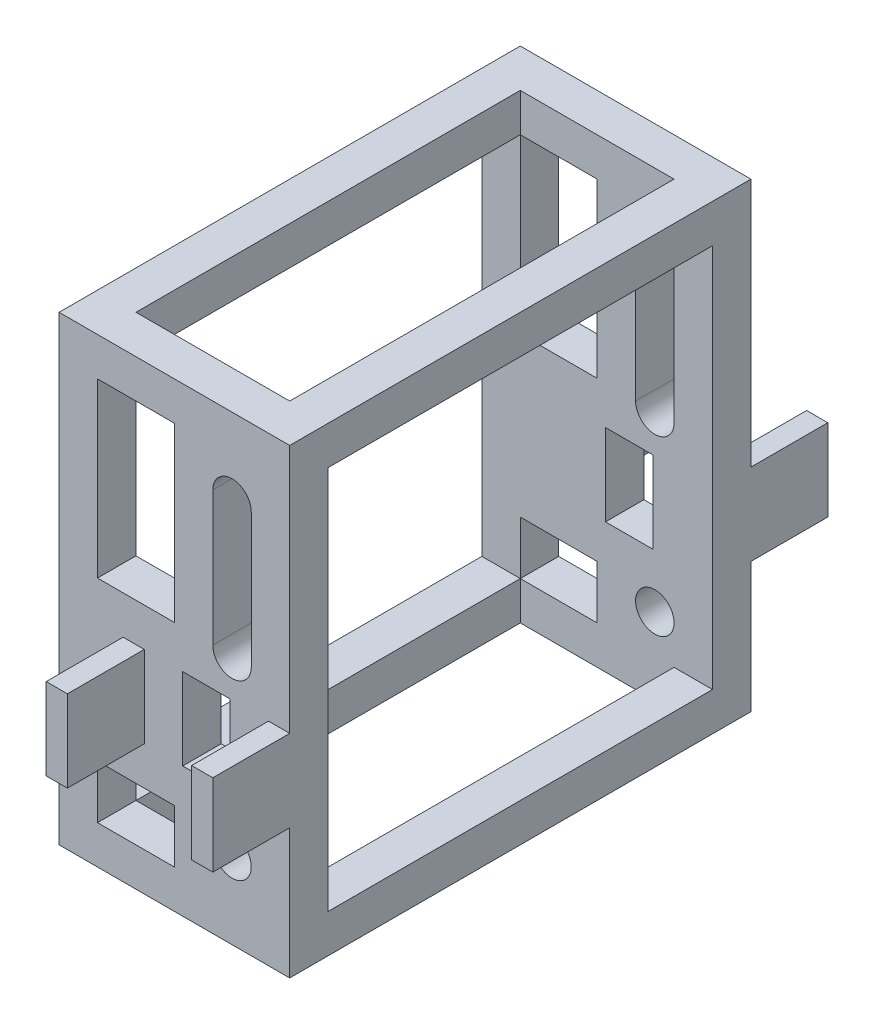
ISO-10303-21;
HEADER;
FILE_DESCRIPTION(('STEP AP214'),'2;1');
FILE_NAME('part.step','',(''),(''),'','','');
FILE_SCHEMA(('AUTOMOTIVE_DESIGN { 1 0 10303 214 1 1 1 1 }'));
ENDSEC;
DATA;
#1=APPLICATION_CONTEXT('core data for automotive mechanical design processes');
#2=APPLICATION_PROTOCOL_DEFINITION('international standard','automotive_design',2000,#1);
#3=PRODUCT_CONTEXT('',#1,'mechanical');
#4=PRODUCT('Part','Part','',(#3));
#5=PRODUCT_RELATED_PRODUCT_CATEGORY('part','',(#4));
#6=PRODUCT_DEFINITION_FORMATION('','',#4);
#7=PRODUCT_DEFINITION_CONTEXT('part definition',#1,'design');
#8=PRODUCT_DEFINITION('design','',#6,#7);
#9=PRODUCT_DEFINITION_SHAPE('','',#8);
#10=(LENGTH_UNIT() NAMED_UNIT(*) SI_UNIT(.MILLI.,.METRE.));
#11=(NAMED_UNIT(*) PLANE_ANGLE_UNIT() SI_UNIT($,.RADIAN.));
#12=(NAMED_UNIT(*) SI_UNIT($,.STERADIAN.) SOLID_ANGLE_UNIT());
#13=UNCERTAINTY_MEASURE_WITH_UNIT(LENGTH_MEASURE(1.E-05),#10,'distance_accuracy_value','');
#14=(GEOMETRIC_REPRESENTATION_CONTEXT(3) GLOBAL_UNCERTAINTY_ASSIGNED_CONTEXT((#13)) GLOBAL_UNIT_ASSIGNED_CONTEXT((#10,
#11,#12)) REPRESENTATION_CONTEXT('',''));
#15=CARTESIAN_POINT('',(0.,0.,0.));
#16=DIRECTION('',(0.,0.,1.));
#17=DIRECTION('',(1.,0.,0.));
#18=AXIS2_PLACEMENT_3D('',#15,#16,#17);
#19=CARTESIAN_POINT('',(0.,0.,0.));
#20=DIRECTION('',(0.,0.,-1.));
#21=DIRECTION('',(-1.,0.,0.));
#22=AXIS2_PLACEMENT_3D('',#19,#20,#21);
#23=PLANE('',#22);
#24=DIRECTION('',(0.,1.,0.));
#25=VECTOR('',#24,1.);
#26=CARTESIAN_POINT('',(12.7,0.,0.));
#27=LINE('',#26,#25);
#28=CARTESIAN_POINT('',(12.7,82.7,0.));
#29=VERTEX_POINT('',#28);
#30=CARTESIAN_POINT('',(12.7,139.7,0.));
#31=VERTEX_POINT('',#30);
#32=EDGE_CURVE('E521',#29,#31,#27,.T.);
#33=ORIENTED_EDGE('',*,*,#32,.F.);
#34=DIRECTION('',(-1.,0.,0.));
#35=VECTOR('',#34,1.);
#36=CARTESIAN_POINT('',(0.,82.7,0.));
#37=LINE('',#36,#35);
#38=CARTESIAN_POINT('',(38.1,82.7,0.));
#39=VERTEX_POINT('',#38);
#40=EDGE_CURVE('E562',#39,#29,#37,.T.);
#41=ORIENTED_EDGE('',*,*,#40,.F.);
#42=DIRECTION('',(0.,-1.,0.));
#43=VECTOR('',#42,1.);
#44=CARTESIAN_POINT('',(38.1,0.,0.));
#45=LINE('',#44,#43);
#46=CARTESIAN_POINT('',(38.1,139.7,0.));
#47=VERTEX_POINT('',#46);
#48=EDGE_CURVE('E567',#47,#39,#45,.T.);
#49=ORIENTED_EDGE('',*,*,#48,.F.);
#50=DIRECTION('',(1.,0.,0.));
#51=VECTOR('',#50,1.);
#52=CARTESIAN_POINT('',(0.,139.7,0.));
#53=LINE('',#52,#51);
#54=EDGE_CURVE('E572',#31,#47,#53,.T.);
#55=ORIENTED_EDGE('',*,*,#54,.F.);
#56=EDGE_LOOP('',(#33,#41,#49,#55));
#57=FACE_BOUND('',#56,.T.);
#58=DIRECTION('',(0.,1.,0.));
#59=VECTOR('',#58,1.);
#60=CARTESIAN_POINT('',(40.85,0.,0.));
#61=LINE('',#60,#59);
#62=CARTESIAN_POINT('',(40.85,43.,0.));
#63=VERTEX_POINT('',#62);
#64=CARTESIAN_POINT('',(40.85,70.,0.));
#65=VERTEX_POINT('',#64);
#66=EDGE_CURVE('E557',#63,#65,#61,.T.);
#67=ORIENTED_EDGE('',*,*,#66,.F.);
#68=DIRECTION('',(-1.,0.,0.));
#69=VECTOR('',#68,1.);
#70=CARTESIAN_POINT('',(0.,43.,0.));
#71=LINE('',#70,#69);
#72=CARTESIAN_POINT('',(56.5,43.,0.));
#73=VERTEX_POINT('',#72);
#74=EDGE_CURVE('E542',#73,#63,#71,.T.);
#75=ORIENTED_EDGE('',*,*,#74,.F.);
#76=DIRECTION('',(0.,-1.,0.));
#77=VECTOR('',#76,1.);
#78=CARTESIAN_POINT('',(56.5,0.,0.));
#79=LINE('',#78,#77);
#80=CARTESIAN_POINT('',(56.5,70.,0.));
#81=VERTEX_POINT('',#80);
#82=EDGE_CURVE('E547',#81,#73,#79,.T.);
#83=ORIENTED_EDGE('',*,*,#82,.F.);
#84=DIRECTION('',(1.,0.,0.));
#85=VECTOR('',#84,1.);
#86=CARTESIAN_POINT('',(0.,70.,0.));
#87=LINE('',#86,#85);
#88=EDGE_CURVE('E552',#65,#81,#87,.T.);
#89=ORIENTED_EDGE('',*,*,#88,.F.);
#90=EDGE_LOOP('',(#67,#75,#83,#89));
#91=FACE_BOUND('',#90,.T.);
#92=DIRECTION('',(0.,1.,0.));
#93=VECTOR('',#92,1.);
#94=CARTESIAN_POINT('',(12.7,0.,0.));
#95=LINE('',#94,#93);
#96=CARTESIAN_POINT('',(12.7,12.7,0.));
#97=VERTEX_POINT('',#96);
#98=CARTESIAN_POINT('',(12.7,30.3,0.));
#99=VERTEX_POINT('',#98);
#100=EDGE_CURVE('E513',#97,#99,#95,.T.);
#101=ORIENTED_EDGE('',*,*,#100,.F.);
#102=DIRECTION('',(-1.,0.,0.));
#103=VECTOR('',#102,1.);
#104=CARTESIAN_POINT('',(0.,12.7,0.));
#105=LINE('',#104,#103);
#106=CARTESIAN_POINT('',(38.1,12.7,0.));
#107=VERTEX_POINT('',#106);
#108=EDGE_CURVE('E526',#107,#97,#105,.T.);
#109=ORIENTED_EDGE('',*,*,#108,.F.);
#110=DIRECTION('',(0.,-1.,0.));
#111=VECTOR('',#110,1.);
#112=CARTESIAN_POINT('',(38.1,0.,0.));
#113=LINE('',#112,#111);
#114=CARTESIAN_POINT('',(38.1,30.3,0.));
#115=VERTEX_POINT('',#114);
#116=EDGE_CURVE('E531',#115,#107,#113,.T.);
#117=ORIENTED_EDGE('',*,*,#116,.F.);
#118=DIRECTION('',(1.,0.,0.));
#119=VECTOR('',#118,1.);
#120=CARTESIAN_POINT('',(0.,30.3,0.));
#121=LINE('',#120,#119);
#122=EDGE_CURVE('E537',#99,#115,#121,.T.);
#123=ORIENTED_EDGE('',*,*,#122,.F.);
#124=EDGE_LOOP('',(#101,#109,#117,#123));
#125=FACE_BOUND('',#124,.T.);
#126=CARTESIAN_POINT('',(57.15,25.4,0.));
#127=DIRECTION('',(0.,0.,-1.));
#128=DIRECTION('',(-1.,0.,0.));
#129=AXIS2_PLACEMENT_3D('',#126,#127,#128);
#130=CIRCLE('',#129,6.35);
#131=CARTESIAN_POINT('',(50.8,25.4,0.));
#132=VERTEX_POINT('',#131);
#133=EDGE_CURVE('E626',#132,#132,#130,.T.);
#134=ORIENTED_EDGE('',*,*,#133,.F.);
#135=EDGE_LOOP('',(#134));
#136=FACE_BOUND('',#135,.T.);
#137=CARTESIAN_POINT('',(57.15,127.,0.));
#138=DIRECTION('',(0.,0.,-1.));
#139=DIRECTION('',(-1.,0.,0.));
#140=AXIS2_PLACEMENT_3D('',#137,#138,#139);
#141=CIRCLE('',#140,6.35);
#142=CARTESIAN_POINT('',(50.8,127.,0.));
#143=VERTEX_POINT('',#142);
#144=CARTESIAN_POINT('',(63.5,127.,0.));
#145=VERTEX_POINT('',#144);
#146=EDGE_CURVE('E620',#143,#145,#141,.T.);
#147=ORIENTED_EDGE('',*,*,#146,.F.);
#148=DIRECTION('',(0.,1.,0.));
#149=VECTOR('',#148,1.);
#150=CARTESIAN_POINT('',(50.8,0.,0.));
#151=LINE('',#150,#149);
#152=CARTESIAN_POINT('',(50.8,82.55,0.));
#153=VERTEX_POINT('',#152);
#154=EDGE_CURVE('E604',#153,#143,#151,.T.);
#155=ORIENTED_EDGE('',*,*,#154,.F.);
#156=CARTESIAN_POINT('',(57.15,82.55,0.));
#157=DIRECTION('',(0.,0.,-1.));
#158=DIRECTION('',(-1.,0.,0.));
#159=AXIS2_PLACEMENT_3D('',#156,#157,#158);
#160=CIRCLE('',#159,6.35);
#161=CARTESIAN_POINT('',(63.5,82.55,0.));
#162=VERTEX_POINT('',#161);
#163=EDGE_CURVE('E609',#162,#153,#160,.T.);
#164=ORIENTED_EDGE('',*,*,#163,.F.);
#165=DIRECTION('',(0.,-1.,0.));
#166=VECTOR('',#165,1.);
#167=CARTESIAN_POINT('',(63.5,0.,0.));
#168=LINE('',#167,#166);
#169=EDGE_CURVE('E615',#145,#162,#168,.T.);
#170=ORIENTED_EDGE('',*,*,#169,.F.);
#171=EDGE_LOOP('',(#147,#155,#164,#170));
#172=FACE_BOUND('',#171,.T.);
#173=DIRECTION('',(0.,1.,0.));
#174=VECTOR('',#173,1.);
#175=CARTESIAN_POINT('',(28.15,70.,0.));
#176=LINE('',#175,#174);
#177=CARTESIAN_POINT('',(28.15,43.,0.));
#178=VERTEX_POINT('',#177);
#179=CARTESIAN_POINT('',(28.15,70.,0.));
#180=VERTEX_POINT('',#179);
#181=EDGE_CURVE('E629',#178,#180,#176,.T.);
#182=ORIENTED_EDGE('',*,*,#181,.T.);
#183=DIRECTION('',(-1.,0.,0.));
#184=VECTOR('',#183,1.);
#185=CARTESIAN_POINT('',(28.15,70.,0.));
#186=LINE('',#185,#184);
#187=CARTESIAN_POINT('',(21.15,70.,0.));
#188=VERTEX_POINT('',#187);
#189=EDGE_CURVE('E634',#180,#188,#186,.T.);
#190=ORIENTED_EDGE('',*,*,#189,.T.);
#191=DIRECTION('',(0.,-1.,0.));
#192=VECTOR('',#191,1.);
#193=CARTESIAN_POINT('',(21.15,70.,0.));
#194=LINE('',#193,#192);
#195=CARTESIAN_POINT('',(21.15,43.,0.));
#196=VERTEX_POINT('',#195);
#197=EDGE_CURVE('E647',#188,#196,#194,.T.);
#198=ORIENTED_EDGE('',*,*,#197,.T.);
#199=DIRECTION('',(1.,0.,0.));
#200=VECTOR('',#199,1.);
#201=CARTESIAN_POINT('',(28.15,43.,0.));
#202=LINE('',#201,#200);
#203=EDGE_CURVE('E645',#196,#178,#202,.T.);
#204=ORIENTED_EDGE('',*,*,#203,.T.);
#205=EDGE_LOOP('',(#182,#190,#198,#204));
#206=FACE_BOUND('',#205,.T.);
#207=DIRECTION('',(0.,-1.,0.));
#208=VECTOR('',#207,1.);
#209=CARTESIAN_POINT('',(69.2,70.,0.));
#210=LINE('',#209,#208);
#211=CARTESIAN_POINT('',(69.2,70.,0.));
#212=VERTEX_POINT('',#211);
#213=CARTESIAN_POINT('',(69.2,43.,0.));
#214=VERTEX_POINT('',#213);
#215=EDGE_CURVE('E661',#212,#214,#210,.T.);
#216=ORIENTED_EDGE('',*,*,#215,.T.);
#217=DIRECTION('',(1.,0.,0.));
#218=VECTOR('',#217,1.);
#219=CARTESIAN_POINT('',(69.2,43.,0.));
#220=LINE('',#219,#218);
#221=CARTESIAN_POINT('',(76.2,43.,0.));
#222=VERTEX_POINT('',#221);
#223=EDGE_CURVE('E666',#214,#222,#220,.T.);
#224=ORIENTED_EDGE('',*,*,#223,.T.);
#225=DIRECTION('',(0.,1.,0.));
#226=VECTOR('',#225,1.);
#227=CARTESIAN_POINT('',(76.2,0.,0.));
#228=LINE('',#227,#226);
#229=CARTESIAN_POINT('',(76.2,0.,0.));
#230=VERTEX_POINT('',#229);
#231=EDGE_CURVE('E863',#230,#222,#228,.T.);
#232=ORIENTED_EDGE('',*,*,#231,.F.);
#233=DIRECTION('',(1.,0.,0.));
#234=VECTOR('',#233,1.);
#235=CARTESIAN_POINT('',(0.,0.,0.));
#236=LINE('',#235,#234);
#237=CARTESIAN_POINT('',(0.,0.,0.));
#238=VERTEX_POINT('',#237);
#239=EDGE_CURVE('E860',#238,#230,#236,.T.);
#240=ORIENTED_EDGE('',*,*,#239,.F.);
#241=DIRECTION('',(0.,-1.,0.));
#242=VECTOR('',#241,1.);
#243=CARTESIAN_POINT('',(0.,0.,0.));
#244=LINE('',#243,#242);
#245=CARTESIAN_POINT('',(0.,152.4,0.));
#246=VERTEX_POINT('',#245);
#247=EDGE_CURVE('E833',#246,#238,#244,.T.);
#248=ORIENTED_EDGE('',*,*,#247,.F.);
#249=DIRECTION('',(-1.,0.,0.));
#250=VECTOR('',#249,1.);
#251=CARTESIAN_POINT('',(0.,152.4,0.));
#252=LINE('',#251,#250);
#253=CARTESIAN_POINT('',(76.2,152.4,0.));
#254=VERTEX_POINT('',#253);
#255=EDGE_CURVE('E850',#254,#246,#252,.T.);
#256=ORIENTED_EDGE('',*,*,#255,.F.);
#257=CARTESIAN_POINT('',(76.2,70.,0.));
#258=VERTEX_POINT('',#257);
#259=EDGE_CURVE('E862',#258,#254,#228,.T.);
#260=ORIENTED_EDGE('',*,*,#259,.F.);
#261=DIRECTION('',(-1.,0.,0.));
#262=VECTOR('',#261,1.);
#263=CARTESIAN_POINT('',(69.2,70.,0.));
#264=LINE('',#263,#262);
#265=EDGE_CURVE('E678',#258,#212,#264,.T.);
#266=ORIENTED_EDGE('',*,*,#265,.T.);
#267=EDGE_LOOP('',(#216,#224,#232,#240,#248,#256,#260,#266));
#268=FACE_BOUND('',#267,.T.);
#269=ADVANCED_FACE('F34',(#57,#91,#125,#136,#172,#206,#268),#23,.T.);
#270=CARTESIAN_POINT('',(0.,0.,152.4));
#271=DIRECTION('',(0.,0.,-1.));
#272=DIRECTION('',(-1.,0.,0.));
#273=AXIS2_PLACEMENT_3D('',#270,#271,#272);
#274=PLANE('',#273);
#275=DIRECTION('',(1.,0.,0.));
#276=VECTOR('',#275,1.);
#277=CARTESIAN_POINT('',(12.7,82.7,152.4));
#278=LINE('',#277,#276);
#279=CARTESIAN_POINT('',(12.7,82.7,152.4));
#280=VERTEX_POINT('',#279);
#281=CARTESIAN_POINT('',(38.1,82.7,152.4));
#282=VERTEX_POINT('',#281);
#283=EDGE_CURVE('E437',#280,#282,#278,.T.);
#284=ORIENTED_EDGE('',*,*,#283,.F.);
#285=DIRECTION('',(0.,-1.,0.));
#286=VECTOR('',#285,1.);
#287=CARTESIAN_POINT('',(12.7,139.7,152.4));
#288=LINE('',#287,#286);
#289=CARTESIAN_POINT('',(12.7,139.7,152.4));
#290=VERTEX_POINT('',#289);
#291=EDGE_CURVE('E443',#290,#280,#288,.T.);
#292=ORIENTED_EDGE('',*,*,#291,.F.);
#293=DIRECTION('',(-1.,0.,0.));
#294=VECTOR('',#293,1.);
#295=CARTESIAN_POINT('',(12.7,139.7,152.4));
#296=LINE('',#295,#294);
#297=CARTESIAN_POINT('',(38.1,139.7,152.4));
#298=VERTEX_POINT('',#297);
#299=EDGE_CURVE('E448',#298,#290,#296,.T.);
#300=ORIENTED_EDGE('',*,*,#299,.F.);
#301=DIRECTION('',(0.,1.,0.));
#302=VECTOR('',#301,1.);
#303=CARTESIAN_POINT('',(38.1,139.7,152.4));
#304=LINE('',#303,#302);
#305=EDGE_CURVE('E428',#282,#298,#304,.T.);
#306=ORIENTED_EDGE('',*,*,#305,.F.);
#307=EDGE_LOOP('',(#284,#292,#300,#306));
#308=FACE_BOUND('',#307,.T.);
#309=DIRECTION('',(1.,0.,0.));
#310=VECTOR('',#309,1.);
#311=CARTESIAN_POINT('',(40.85,43.,152.4));
#312=LINE('',#311,#310);
#313=CARTESIAN_POINT('',(40.85,43.,152.4));
#314=VERTEX_POINT('',#313);
#315=CARTESIAN_POINT('',(56.5,43.,152.4));
#316=VERTEX_POINT('',#315);
#317=EDGE_CURVE('E462',#314,#316,#312,.T.);
#318=ORIENTED_EDGE('',*,*,#317,.F.);
#319=DIRECTION('',(0.,-1.,0.));
#320=VECTOR('',#319,1.);
#321=CARTESIAN_POINT('',(40.85,70.,152.4));
#322=LINE('',#321,#320);
#323=CARTESIAN_POINT('',(40.85,70.,152.4));
#324=VERTEX_POINT('',#323);
#325=EDGE_CURVE('E460',#324,#314,#322,.T.);
#326=ORIENTED_EDGE('',*,*,#325,.F.);
#327=DIRECTION('',(-1.,0.,0.));
#328=VECTOR('',#327,1.);
#329=CARTESIAN_POINT('',(40.85,70.,152.4));
#330=LINE('',#329,#328);
#331=CARTESIAN_POINT('',(56.5,70.,152.4));
#332=VERTEX_POINT('',#331);
#333=EDGE_CURVE('E469',#332,#324,#330,.T.);
#334=ORIENTED_EDGE('',*,*,#333,.F.);
#335=DIRECTION('',(0.,1.,0.));
#336=VECTOR('',#335,1.);
#337=CARTESIAN_POINT('',(56.5,70.,152.4));
#338=LINE('',#337,#336);
#339=EDGE_CURVE('E466',#316,#332,#338,.T.);
#340=ORIENTED_EDGE('',*,*,#339,.F.);
#341=EDGE_LOOP('',(#318,#326,#334,#340));
#342=FACE_BOUND('',#341,.T.);
#343=DIRECTION('',(1.,0.,0.));
#344=VECTOR('',#343,1.);
#345=CARTESIAN_POINT('',(12.7,12.7,152.4));
#346=LINE('',#345,#344);
#347=CARTESIAN_POINT('',(12.7,12.7,152.4));
#348=VERTEX_POINT('',#347);
#349=CARTESIAN_POINT('',(38.1,12.7,152.4));
#350=VERTEX_POINT('',#349);
#351=EDGE_CURVE('E486',#348,#350,#346,.T.);
#352=ORIENTED_EDGE('',*,*,#351,.F.);
#353=DIRECTION('',(0.,-1.,0.));
#354=VECTOR('',#353,1.);
#355=CARTESIAN_POINT('',(12.7,30.3,152.4));
#356=LINE('',#355,#354);
#357=CARTESIAN_POINT('',(12.7,30.3,152.4));
#358=VERTEX_POINT('',#357);
#359=EDGE_CURVE('E484',#358,#348,#356,.T.);
#360=ORIENTED_EDGE('',*,*,#359,.F.);
#361=DIRECTION('',(-1.,0.,0.));
#362=VECTOR('',#361,1.);
#363=CARTESIAN_POINT('',(12.7,30.3,152.4));
#364=LINE('',#363,#362);
#365=CARTESIAN_POINT('',(38.1,30.3,152.4));
#366=VERTEX_POINT('',#365);
#367=EDGE_CURVE('E492',#366,#358,#364,.T.);
#368=ORIENTED_EDGE('',*,*,#367,.F.);
#369=DIRECTION('',(0.,1.,0.));
#370=VECTOR('',#369,1.);
#371=CARTESIAN_POINT('',(38.1,30.3,152.4));
#372=LINE('',#371,#370);
#373=EDGE_CURVE('E489',#350,#366,#372,.T.);
#374=ORIENTED_EDGE('',*,*,#373,.F.);
#375=EDGE_LOOP('',(#352,#360,#368,#374));
#376=FACE_BOUND('',#375,.T.);
#377=CARTESIAN_POINT('',(57.15,25.4,152.4));
#378=DIRECTION('',(0.,0.,1.));
#379=DIRECTION('',(1.,0.,0.));
#380=AXIS2_PLACEMENT_3D('',#377,#378,#379);
#381=CIRCLE('',#380,6.35);
#382=CARTESIAN_POINT('',(63.5,25.4,152.4));
#383=VERTEX_POINT('',#382);
#384=EDGE_CURVE('E575',#383,#383,#381,.T.);
#385=ORIENTED_EDGE('',*,*,#384,.F.);
#386=EDGE_LOOP('',(#385));
#387=FACE_BOUND('',#386,.T.);
#388=DIRECTION('',(0.,-1.,0.));
#389=VECTOR('',#388,1.);
#390=CARTESIAN_POINT('',(50.8,127.,152.4));
#391=LINE('',#390,#389);
#392=CARTESIAN_POINT('',(50.8,127.,152.4));
#393=VERTEX_POINT('',#392);
#394=CARTESIAN_POINT('',(50.8,82.55,152.4));
#395=VERTEX_POINT('',#394);
#396=EDGE_CURVE('E581',#393,#395,#391,.T.);
#397=ORIENTED_EDGE('',*,*,#396,.F.);
#398=CARTESIAN_POINT('',(57.15,127.,152.4));
#399=DIRECTION('',(0.,0.,1.));
#400=DIRECTION('',(1.,0.,0.));
#401=AXIS2_PLACEMENT_3D('',#398,#399,#400);
#402=CIRCLE('',#401,6.35);
#403=CARTESIAN_POINT('',(63.5,127.,152.4));
#404=VERTEX_POINT('',#403);
#405=EDGE_CURVE('E574',#404,#393,#402,.T.);
#406=ORIENTED_EDGE('',*,*,#405,.F.);
#407=DIRECTION('',(0.,1.,0.));
#408=VECTOR('',#407,1.);
#409=CARTESIAN_POINT('',(63.5,127.,152.4));
#410=LINE('',#409,#408);
#411=CARTESIAN_POINT('',(63.5,82.55,152.4));
#412=VERTEX_POINT('',#411);
#413=EDGE_CURVE('E587',#412,#404,#410,.T.);
#414=ORIENTED_EDGE('',*,*,#413,.F.);
#415=CARTESIAN_POINT('',(57.15,82.55,152.4));
#416=DIRECTION('',(0.,0.,1.));
#417=DIRECTION('',(1.,0.,0.));
#418=AXIS2_PLACEMENT_3D('',#415,#416,#417);
#419=CIRCLE('',#418,6.35);
#420=EDGE_CURVE('E584',#395,#412,#419,.T.);
#421=ORIENTED_EDGE('',*,*,#420,.F.);
#422=EDGE_LOOP('',(#397,#406,#414,#421));
#423=FACE_BOUND('',#422,.T.);
#424=DIRECTION('',(-1.,0.,0.));
#425=VECTOR('',#424,1.);
#426=CARTESIAN_POINT('',(69.2,70.,152.4));
#427=LINE('',#426,#425);
#428=CARTESIAN_POINT('',(76.2,70.,152.4));
#429=VERTEX_POINT('',#428);
#430=CARTESIAN_POINT('',(69.2,70.,152.4));
#431=VERTEX_POINT('',#430);
#432=EDGE_CURVE('E729',#429,#431,#427,.T.);
#433=ORIENTED_EDGE('',*,*,#432,.F.);
#434=DIRECTION('',(0.,1.,0.));
#435=VECTOR('',#434,1.);
#436=CARTESIAN_POINT('',(76.2,0.,152.4));
#437=LINE('',#436,#435);
#438=CARTESIAN_POINT('',(76.2,152.4,152.4));
#439=VERTEX_POINT('',#438);
#440=EDGE_CURVE('E852',#429,#439,#437,.T.);
#441=ORIENTED_EDGE('',*,*,#440,.T.);
#442=DIRECTION('',(-1.,0.,0.));
#443=VECTOR('',#442,1.);
#444=CARTESIAN_POINT('',(0.,152.4,152.4));
#445=LINE('',#444,#443);
#446=CARTESIAN_POINT('',(0.,152.4,152.4));
#447=VERTEX_POINT('',#446);
#448=EDGE_CURVE('E855',#439,#447,#445,.T.);
#449=ORIENTED_EDGE('',*,*,#448,.T.);
#450=DIRECTION('',(0.,-1.,0.));
#451=VECTOR('',#450,1.);
#452=CARTESIAN_POINT('',(0.,0.,152.4));
#453=LINE('',#452,#451);
#454=CARTESIAN_POINT('',(0.,0.,152.4));
#455=VERTEX_POINT('',#454);
#456=EDGE_CURVE('E846',#447,#455,#453,.T.);
#457=ORIENTED_EDGE('',*,*,#456,.T.);
#458=DIRECTION('',(1.,0.,0.));
#459=VECTOR('',#458,1.);
#460=CARTESIAN_POINT('',(0.,0.,152.4));
#461=LINE('',#460,#459);
#462=CARTESIAN_POINT('',(76.2,0.,152.4));
#463=VERTEX_POINT('',#462);
#464=EDGE_CURVE('E849',#455,#463,#461,.T.);
#465=ORIENTED_EDGE('',*,*,#464,.T.);
#466=CARTESIAN_POINT('',(76.2,43.,152.4));
#467=VERTEX_POINT('',#466);
#468=EDGE_CURVE('E853',#463,#467,#437,.T.);
#469=ORIENTED_EDGE('',*,*,#468,.T.);
#470=DIRECTION('',(1.,0.,0.));
#471=VECTOR('',#470,1.);
#472=CARTESIAN_POINT('',(69.2,43.,152.4));
#473=LINE('',#472,#471);
#474=CARTESIAN_POINT('',(69.2,43.,152.4));
#475=VERTEX_POINT('',#474);
#476=EDGE_CURVE('E738',#475,#467,#473,.T.);
#477=ORIENTED_EDGE('',*,*,#476,.F.);
#478=DIRECTION('',(0.,-1.,0.));
#479=VECTOR('',#478,1.);
#480=CARTESIAN_POINT('',(69.2,70.,152.4));
#481=LINE('',#480,#479);
#482=EDGE_CURVE('E724',#431,#475,#481,.T.);
#483=ORIENTED_EDGE('',*,*,#482,.F.);
#484=EDGE_LOOP('',(#433,#441,#449,#457,#465,#469,#477,#483));
#485=FACE_BOUND('',#484,.T.);
#486=DIRECTION('',(0.,1.,0.));
#487=VECTOR('',#486,1.);
#488=CARTESIAN_POINT('',(28.15,70.,152.4));
#489=LINE('',#488,#487);
#490=CARTESIAN_POINT('',(28.15,43.,152.4));
#491=VERTEX_POINT('',#490);
#492=CARTESIAN_POINT('',(28.15,70.,152.4));
#493=VERTEX_POINT('',#492);
#494=EDGE_CURVE('E691',#491,#493,#489,.T.);
#495=ORIENTED_EDGE('',*,*,#494,.F.);
#496=DIRECTION('',(1.,0.,0.));
#497=VECTOR('',#496,1.);
#498=CARTESIAN_POINT('',(28.15,43.,152.4));
#499=LINE('',#498,#497);
#500=CARTESIAN_POINT('',(21.15,43.,152.4));
#501=VERTEX_POINT('',#500);
#502=EDGE_CURVE('E696',#501,#491,#499,.T.);
#503=ORIENTED_EDGE('',*,*,#502,.F.);
#504=DIRECTION('',(0.,-1.,0.));
#505=VECTOR('',#504,1.);
#506=CARTESIAN_POINT('',(21.15,70.,152.4));
#507=LINE('',#506,#505);
#508=CARTESIAN_POINT('',(21.15,70.,152.4));
#509=VERTEX_POINT('',#508);
#510=EDGE_CURVE('E708',#509,#501,#507,.T.);
#511=ORIENTED_EDGE('',*,*,#510,.F.);
#512=DIRECTION('',(-1.,0.,0.));
#513=VECTOR('',#512,1.);
#514=CARTESIAN_POINT('',(28.15,70.,152.4));
#515=LINE('',#514,#513);
#516=EDGE_CURVE('E705',#493,#509,#515,.T.);
#517=ORIENTED_EDGE('',*,*,#516,.F.);
#518=EDGE_LOOP('',(#495,#503,#511,#517));
#519=FACE_BOUND('',#518,.T.);
#520=ADVANCED_FACE('F445',(#308,#342,#376,#387,#423,#485,#519),#274,.F.);
#521=CARTESIAN_POINT('',(12.7,0.,12.7));
#522=DIRECTION('',(-1.,0.,0.));
#523=DIRECTION('',(0.,0.,1.));
#524=AXIS2_PLACEMENT_3D('',#521,#522,#523);
#525=PLANE('',#524);
#526=DIRECTION('',(0.,1.,0.));
#527=VECTOR('',#526,1.);
#528=CARTESIAN_POINT('',(12.7,0.,139.7));
#529=LINE('',#528,#527);
#530=CARTESIAN_POINT('',(12.7,139.7,139.7));
#531=VERTEX_POINT('',#530);
#532=CARTESIAN_POINT('',(12.7,152.4,139.7));
#533=VERTEX_POINT('',#532);
#534=EDGE_CURVE('E819',#531,#533,#529,.T.);
#535=ORIENTED_EDGE('',*,*,#534,.F.);
#536=DIRECTION('',(0.,0.,-1.));
#537=VECTOR('',#536,1.);
#538=CARTESIAN_POINT('',(12.7,139.7,12.7));
#539=LINE('',#538,#537);
#540=CARTESIAN_POINT('',(12.7,139.7,12.7));
#541=VERTEX_POINT('',#540);
#542=EDGE_CURVE('E802',#531,#541,#539,.T.);
#543=ORIENTED_EDGE('',*,*,#542,.T.);
#544=DIRECTION('',(0.,1.,0.));
#545=VECTOR('',#544,1.);
#546=CARTESIAN_POINT('',(12.7,0.,12.7));
#547=LINE('',#546,#545);
#548=CARTESIAN_POINT('',(12.7,152.4,12.7));
#549=VERTEX_POINT('',#548);
#550=EDGE_CURVE('E834',#541,#549,#547,.T.);
#551=ORIENTED_EDGE('',*,*,#550,.T.);
#552=DIRECTION('',(0.,0.,1.));
#553=VECTOR('',#552,1.);
#554=CARTESIAN_POINT('',(12.7,152.4,12.7));
#555=LINE('',#554,#553);
#556=EDGE_CURVE('E805',#549,#533,#555,.T.);
#557=ORIENTED_EDGE('',*,*,#556,.T.);
#558=EDGE_LOOP('',(#535,#543,#551,#557));
#559=FACE_BOUND('',#558,.T.);
#560=ADVANCED_FACE('F964',(#559),#525,.F.);
#561=CARTESIAN_POINT('',(63.5,0.,12.7));
#562=DIRECTION('',(1.,0.,0.));
#563=DIRECTION('',(0.,0.,-1.));
#564=AXIS2_PLACEMENT_3D('',#561,#562,#563);
#565=PLANE('',#564);
#566=DIRECTION('',(0.,1.,0.));
#567=VECTOR('',#566,1.);
#568=CARTESIAN_POINT('',(63.5,0.,12.7));
#569=LINE('',#568,#567);
#570=CARTESIAN_POINT('',(63.5,139.7,12.7));
#571=VERTEX_POINT('',#570);
#572=CARTESIAN_POINT('',(63.5,152.4,12.7));
#573=VERTEX_POINT('',#572);
#574=EDGE_CURVE('E838',#571,#573,#569,.T.);
#575=ORIENTED_EDGE('',*,*,#574,.F.);
#576=DIRECTION('',(0.,0.,1.));
#577=VECTOR('',#576,1.);
#578=CARTESIAN_POINT('',(63.5,139.7,12.7));
#579=LINE('',#578,#577);
#580=CARTESIAN_POINT('',(63.5,139.7,139.7));
#581=VERTEX_POINT('',#580);
#582=EDGE_CURVE('E799',#571,#581,#579,.T.);
#583=ORIENTED_EDGE('',*,*,#582,.T.);
#584=DIRECTION('',(0.,1.,0.));
#585=VECTOR('',#584,1.);
#586=CARTESIAN_POINT('',(63.5,0.,139.7));
#587=LINE('',#586,#585);
#588=CARTESIAN_POINT('',(63.5,152.4,139.7));
#589=VERTEX_POINT('',#588);
#590=EDGE_CURVE('E842',#581,#589,#587,.T.);
#591=ORIENTED_EDGE('',*,*,#590,.T.);
#592=DIRECTION('',(0.,0.,-1.));
#593=VECTOR('',#592,1.);
#594=CARTESIAN_POINT('',(63.5,152.4,12.7));
#595=LINE('',#594,#593);
#596=EDGE_CURVE('E825',#589,#573,#595,.T.);
#597=ORIENTED_EDGE('',*,*,#596,.T.);
#598=EDGE_LOOP('',(#575,#583,#591,#597));
#599=FACE_BOUND('',#598,.T.);
#600=ADVANCED_FACE('F983',(#599),#565,.F.);
#601=CARTESIAN_POINT('',(0.,0.,152.4));
#602=DIRECTION('',(1.,0.,0.));
#603=DIRECTION('',(0.,0.,-1.));
#604=AXIS2_PLACEMENT_3D('',#601,#602,#603);
#605=PLANE('',#604);
#606=DIRECTION('',(0.,0.,1.));
#607=VECTOR('',#606,1.);
#608=CARTESIAN_POINT('',(0.,139.7,139.7));
#609=LINE('',#608,#607);
#610=CARTESIAN_POINT('',(0.,139.7,12.7));
#611=VERTEX_POINT('',#610);
#612=CARTESIAN_POINT('',(0.,139.7,139.7));
#613=VERTEX_POINT('',#612);
#614=EDGE_CURVE('E765',#611,#613,#609,.T.);
#615=ORIENTED_EDGE('',*,*,#614,.T.);
#616=DIRECTION('',(0.,-1.,0.));
#617=VECTOR('',#616,1.);
#618=CARTESIAN_POINT('',(0.,139.7,139.7));
#619=LINE('',#618,#617);
#620=CARTESIAN_POINT('',(0.,12.7,139.7));
#621=VERTEX_POINT('',#620);
#622=EDGE_CURVE('E755',#613,#621,#619,.T.);
#623=ORIENTED_EDGE('',*,*,#622,.T.);
#624=DIRECTION('',(0.,0.,-1.));
#625=VECTOR('',#624,1.);
#626=CARTESIAN_POINT('',(0.,12.7,139.7));
#627=LINE('',#626,#625);
#628=CARTESIAN_POINT('',(0.,12.7,12.7));
#629=VERTEX_POINT('',#628);
#630=EDGE_CURVE('E758',#621,#629,#627,.T.);
#631=ORIENTED_EDGE('',*,*,#630,.T.);
#632=DIRECTION('',(0.,1.,0.));
#633=VECTOR('',#632,1.);
#634=CARTESIAN_POINT('',(0.,139.7,12.7));
#635=LINE('',#634,#633);
#636=EDGE_CURVE('E762',#629,#611,#635,.T.);
#637=ORIENTED_EDGE('',*,*,#636,.T.);
#638=EDGE_LOOP('',(#615,#623,#631,#637));
#639=FACE_BOUND('',#638,.T.);
#640=ORIENTED_EDGE('',*,*,#247,.T.);
#641=DIRECTION('',(0.,0.,-1.));
#642=VECTOR('',#641,1.);
#643=CARTESIAN_POINT('',(0.,0.,152.4));
#644=LINE('',#643,#642);
#645=EDGE_CURVE('E875',#455,#238,#644,.T.);
#646=ORIENTED_EDGE('',*,*,#645,.F.);
#647=ORIENTED_EDGE('',*,*,#456,.F.);
#648=DIRECTION('',(0.,0.,-1.));
#649=VECTOR('',#648,1.);
#650=CARTESIAN_POINT('',(0.,152.4,152.4));
#651=LINE('',#650,#649);
#652=EDGE_CURVE('E857',#447,#246,#651,.T.);
#653=ORIENTED_EDGE('',*,*,#652,.T.);
#654=EDGE_LOOP('',(#640,#646,#647,#653));
#655=FACE_BOUND('',#654,.T.);
#656=ADVANCED_FACE('F36',(#639,#655),#605,.F.);
#657=CARTESIAN_POINT('',(0.,0.,152.4));
#658=DIRECTION('',(0.,1.,0.));
#659=DIRECTION('',(0.,0.,1.));
#660=AXIS2_PLACEMENT_3D('',#657,#658,#659);
#661=PLANE('',#660);
#662=DIRECTION('',(-1.,0.,0.));
#663=VECTOR('',#662,1.);
#664=CARTESIAN_POINT('',(12.7,0.,12.7));
#665=LINE('',#664,#663);
#666=CARTESIAN_POINT('',(63.5,0.,12.7));
#667=VERTEX_POINT('',#666);
#668=CARTESIAN_POINT('',(12.7,0.,12.7));
#669=VERTEX_POINT('',#668);
#670=EDGE_CURVE('E816',#667,#669,#665,.T.);
#671=ORIENTED_EDGE('',*,*,#670,.T.);
#672=DIRECTION('',(0.,0.,1.));
#673=VECTOR('',#672,1.);
#674=CARTESIAN_POINT('',(12.7,0.,12.7));
#675=LINE('',#674,#673);
#676=CARTESIAN_POINT('',(12.7,0.,139.7));
#677=VERTEX_POINT('',#676);
#678=EDGE_CURVE('E806',#669,#677,#675,.T.);
#679=ORIENTED_EDGE('',*,*,#678,.T.);
#680=DIRECTION('',(1.,0.,0.));
#681=VECTOR('',#680,1.);
#682=CARTESIAN_POINT('',(12.7,0.,139.7));
#683=LINE('',#682,#681);
#684=CARTESIAN_POINT('',(63.5,0.,139.7));
#685=VERTEX_POINT('',#684);
#686=EDGE_CURVE('E809',#677,#685,#683,.T.);
#687=ORIENTED_EDGE('',*,*,#686,.T.);
#688=DIRECTION('',(0.,0.,-1.));
#689=VECTOR('',#688,1.);
#690=CARTESIAN_POINT('',(63.5,0.,12.7));
#691=LINE('',#690,#689);
#692=EDGE_CURVE('E813',#685,#667,#691,.T.);
#693=ORIENTED_EDGE('',*,*,#692,.T.);
#694=EDGE_LOOP('',(#671,#679,#687,#693));
#695=FACE_BOUND('',#694,.T.);
#696=ORIENTED_EDGE('',*,*,#239,.T.);
#697=DIRECTION('',(0.,0.,-1.));
#698=VECTOR('',#697,1.);
#699=CARTESIAN_POINT('',(76.2,0.,152.4));
#700=LINE('',#699,#698);
#701=EDGE_CURVE('E872',#463,#230,#700,.T.);
#702=ORIENTED_EDGE('',*,*,#701,.F.);
#703=ORIENTED_EDGE('',*,*,#464,.F.);
#704=ORIENTED_EDGE('',*,*,#645,.T.);
#705=EDGE_LOOP('',(#696,#702,#703,#704));
#706=FACE_BOUND('',#705,.T.);
#707=ADVANCED_FACE('F976',(#695,#706),#661,.F.);
#708=CARTESIAN_POINT('',(76.2,0.,152.4));
#709=DIRECTION('',(-1.,0.,0.));
#710=DIRECTION('',(0.,0.,1.));
#711=AXIS2_PLACEMENT_3D('',#708,#709,#710);
#712=PLANE('',#711);
#713=DIRECTION('',(0.,0.,-1.));
#714=VECTOR('',#713,1.);
#715=CARTESIAN_POINT('',(76.2,12.7,139.7));
#716=LINE('',#715,#714);
#717=CARTESIAN_POINT('',(76.2,12.7,139.7));
#718=VERTEX_POINT('',#717);
#719=CARTESIAN_POINT('',(76.2,12.7,12.7));
#720=VERTEX_POINT('',#719);
#721=EDGE_CURVE('E770',#718,#720,#716,.T.);
#722=ORIENTED_EDGE('',*,*,#721,.F.);
#723=DIRECTION('',(0.,-1.,0.));
#724=VECTOR('',#723,1.);
#725=CARTESIAN_POINT('',(76.2,139.7,139.7));
#726=LINE('',#725,#724);
#727=CARTESIAN_POINT('',(76.2,139.7,139.7));
#728=VERTEX_POINT('',#727);
#729=EDGE_CURVE('E754',#728,#718,#726,.T.);
#730=ORIENTED_EDGE('',*,*,#729,.F.);
#731=DIRECTION('',(0.,0.,1.));
#732=VECTOR('',#731,1.);
#733=CARTESIAN_POINT('',(76.2,139.7,139.7));
#734=LINE('',#733,#732);
#735=CARTESIAN_POINT('',(76.2,139.7,12.7));
#736=VERTEX_POINT('',#735);
#737=EDGE_CURVE('E759',#736,#728,#734,.T.);
#738=ORIENTED_EDGE('',*,*,#737,.F.);
#739=DIRECTION('',(0.,1.,0.));
#740=VECTOR('',#739,1.);
#741=CARTESIAN_POINT('',(76.2,139.7,12.7));
#742=LINE('',#741,#740);
#743=EDGE_CURVE('E773',#720,#736,#742,.T.);
#744=ORIENTED_EDGE('',*,*,#743,.F.);
#745=EDGE_LOOP('',(#722,#730,#738,#744));
#746=FACE_BOUND('',#745,.T.);
#747=ORIENTED_EDGE('',*,*,#231,.T.);
#748=DIRECTION('',(0.,0.,1.));
#749=VECTOR('',#748,1.);
#750=CARTESIAN_POINT('',(76.2,43.,-25.4));
#751=LINE('',#750,#749);
#752=CARTESIAN_POINT('',(76.2,43.,-25.4));
#753=VERTEX_POINT('',#752);
#754=EDGE_CURVE('E684',#753,#222,#751,.T.);
#755=ORIENTED_EDGE('',*,*,#754,.F.);
#756=DIRECTION('',(0.,1.,0.));
#757=VECTOR('',#756,1.);
#758=CARTESIAN_POINT('',(76.2,70.,-25.4));
#759=LINE('',#758,#757);
#760=CARTESIAN_POINT('',(76.2,70.,-25.4));
#761=VERTEX_POINT('',#760);
#762=EDGE_CURVE('E669',#753,#761,#759,.T.);
#763=ORIENTED_EDGE('',*,*,#762,.T.);
#764=DIRECTION('',(0.,0.,1.));
#765=VECTOR('',#764,1.);
#766=CARTESIAN_POINT('',(76.2,70.,-25.4));
#767=LINE('',#766,#765);
#768=EDGE_CURVE('E686',#761,#258,#767,.T.);
#769=ORIENTED_EDGE('',*,*,#768,.T.);
#770=ORIENTED_EDGE('',*,*,#259,.T.);
#771=DIRECTION('',(0.,0.,-1.));
#772=VECTOR('',#771,1.);
#773=CARTESIAN_POINT('',(76.2,152.4,152.4));
#774=LINE('',#773,#772);
#775=EDGE_CURVE('E869',#439,#254,#774,.T.);
#776=ORIENTED_EDGE('',*,*,#775,.F.);
#777=ORIENTED_EDGE('',*,*,#440,.F.);
#778=DIRECTION('',(0.,0.,-1.));
#779=VECTOR('',#778,1.);
#780=CARTESIAN_POINT('',(76.2,70.,177.8));
#781=LINE('',#780,#779);
#782=CARTESIAN_POINT('',(76.2,70.,177.8));
#783=VERTEX_POINT('',#782);
#784=EDGE_CURVE('E745',#783,#429,#781,.T.);
#785=ORIENTED_EDGE('',*,*,#784,.F.);
#786=DIRECTION('',(0.,1.,0.));
#787=VECTOR('',#786,1.);
#788=CARTESIAN_POINT('',(76.2,70.,177.8));
#789=LINE('',#788,#787);
#790=CARTESIAN_POINT('',(76.2,43.,177.8));
#791=VERTEX_POINT('',#790);
#792=EDGE_CURVE('E731',#791,#783,#789,.T.);
#793=ORIENTED_EDGE('',*,*,#792,.F.);
#794=DIRECTION('',(0.,0.,-1.));
#795=VECTOR('',#794,1.);
#796=CARTESIAN_POINT('',(76.2,43.,177.8));
#797=LINE('',#796,#795);
#798=EDGE_CURVE('E748',#791,#467,#797,.T.);
#799=ORIENTED_EDGE('',*,*,#798,.T.);
#800=ORIENTED_EDGE('',*,*,#468,.F.);
#801=ORIENTED_EDGE('',*,*,#701,.T.);
#802=EDGE_LOOP('',(#747,#755,#763,#769,#770,#776,#777,#785,#793,#799,#800,#801));
#803=FACE_BOUND('',#802,.T.);
#804=ADVANCED_FACE('F973',(#746,#803),#712,.F.);
#805=CARTESIAN_POINT('',(0.,152.4,152.4));
#806=DIRECTION('',(0.,-1.,0.));
#807=DIRECTION('',(0.,0.,-1.));
#808=AXIS2_PLACEMENT_3D('',#805,#806,#807);
#809=PLANE('',#808);
#810=DIRECTION('',(1.,0.,0.));
#811=VECTOR('',#810,1.);
#812=CARTESIAN_POINT('',(12.7,152.4,139.7));
#813=LINE('',#812,#811);
#814=EDGE_CURVE('E822',#533,#589,#813,.T.);
#815=ORIENTED_EDGE('',*,*,#814,.F.);
#816=ORIENTED_EDGE('',*,*,#556,.F.);
#817=DIRECTION('',(-1.,0.,0.));
#818=VECTOR('',#817,1.);
#819=CARTESIAN_POINT('',(12.7,152.4,12.7));
#820=LINE('',#819,#818);
#821=EDGE_CURVE('E810',#573,#549,#820,.T.);
#822=ORIENTED_EDGE('',*,*,#821,.F.);
#823=ORIENTED_EDGE('',*,*,#596,.F.);
#824=EDGE_LOOP('',(#815,#816,#822,#823));
#825=FACE_BOUND('',#824,.T.);
#826=ORIENTED_EDGE('',*,*,#255,.T.);
#827=ORIENTED_EDGE('',*,*,#652,.F.);
#828=ORIENTED_EDGE('',*,*,#448,.F.);
#829=ORIENTED_EDGE('',*,*,#775,.T.);
#830=EDGE_LOOP('',(#826,#827,#828,#829));
#831=FACE_BOUND('',#830,.T.);
#832=ADVANCED_FACE('F969',(#825,#831),#809,.F.);
#833=CARTESIAN_POINT('',(12.7,12.7,12.7));
#834=VERTEX_POINT('',#833);
#835=EDGE_CURVE('E830',#669,#834,#547,.T.);
#836=ORIENTED_EDGE('',*,*,#835,.T.);
#837=DIRECTION('',(0.,0.,1.));
#838=VECTOR('',#837,1.);
#839=CARTESIAN_POINT('',(12.7,12.7,12.7));
#840=LINE('',#839,#838);
#841=CARTESIAN_POINT('',(12.7,12.7,139.7));
#842=VERTEX_POINT('',#841);
#843=EDGE_CURVE('E796',#834,#842,#840,.T.);
#844=ORIENTED_EDGE('',*,*,#843,.T.);
#845=EDGE_CURVE('E843',#677,#842,#529,.T.);
#846=ORIENTED_EDGE('',*,*,#845,.F.);
#847=ORIENTED_EDGE('',*,*,#678,.F.);
#848=EDGE_LOOP('',(#836,#844,#846,#847));
#849=FACE_BOUND('',#848,.T.);
#850=ADVANCED_FACE('F972',(#849),#525,.F.);
#851=CARTESIAN_POINT('',(12.7,0.,12.7));
#852=DIRECTION('',(0.,0.,-1.));
#853=DIRECTION('',(-1.,0.,0.));
#854=AXIS2_PLACEMENT_3D('',#851,#852,#853);
#855=PLANE('',#854);
#856=DIRECTION('',(-1.,0.,0.));
#857=VECTOR('',#856,1.);
#858=CARTESIAN_POINT('',(12.7,43.,12.7));
#859=LINE('',#858,#857);
#860=CARTESIAN_POINT('',(56.5,43.,12.7));
#861=VERTEX_POINT('',#860);
#862=CARTESIAN_POINT('',(40.85,43.,12.7));
#863=VERTEX_POINT('',#862);
#864=EDGE_CURVE('E539',#861,#863,#859,.T.);
#865=ORIENTED_EDGE('',*,*,#864,.T.);
#866=DIRECTION('',(0.,1.,0.));
#867=VECTOR('',#866,1.);
#868=CARTESIAN_POINT('',(40.85,0.,12.7));
#869=LINE('',#868,#867);
#870=CARTESIAN_POINT('',(40.85,70.,12.7));
#871=VERTEX_POINT('',#870);
#872=EDGE_CURVE('E554',#863,#871,#869,.T.);
#873=ORIENTED_EDGE('',*,*,#872,.T.);
#874=DIRECTION('',(1.,0.,0.));
#875=VECTOR('',#874,1.);
#876=CARTESIAN_POINT('',(12.7,70.,12.7));
#877=LINE('',#876,#875);
#878=CARTESIAN_POINT('',(56.5,70.,12.7));
#879=VERTEX_POINT('',#878);
#880=EDGE_CURVE('E549',#871,#879,#877,.T.);
#881=ORIENTED_EDGE('',*,*,#880,.T.);
#882=DIRECTION('',(0.,-1.,0.));
#883=VECTOR('',#882,1.);
#884=CARTESIAN_POINT('',(56.5,0.,12.7));
#885=LINE('',#884,#883);
#886=EDGE_CURVE('E544',#879,#861,#885,.T.);
#887=ORIENTED_EDGE('',*,*,#886,.T.);
#888=EDGE_LOOP('',(#865,#873,#881,#887));
#889=FACE_BOUND('',#888,.T.);
#890=CARTESIAN_POINT('',(57.15,25.4,12.7));
#891=DIRECTION('',(0.,0.,-1.));
#892=DIRECTION('',(-1.,0.,0.));
#893=AXIS2_PLACEMENT_3D('',#890,#891,#892);
#894=CIRCLE('',#893,6.35);
#895=CARTESIAN_POINT('',(50.8,25.4,12.7));
#896=VERTEX_POINT('',#895);
#897=EDGE_CURVE('E623',#896,#896,#894,.T.);
#898=ORIENTED_EDGE('',*,*,#897,.T.);
#899=EDGE_LOOP('',(#898));
#900=FACE_BOUND('',#899,.T.);
#901=DIRECTION('',(0.,1.,0.));
#902=VECTOR('',#901,1.);
#903=CARTESIAN_POINT('',(50.8,0.,12.7));
#904=LINE('',#903,#902);
#905=CARTESIAN_POINT('',(50.8,82.55,12.7));
#906=VERTEX_POINT('',#905);
#907=CARTESIAN_POINT('',(50.8,127.,12.7));
#908=VERTEX_POINT('',#907);
#909=EDGE_CURVE('E578',#906,#908,#904,.T.);
#910=ORIENTED_EDGE('',*,*,#909,.T.);
#911=CARTESIAN_POINT('',(57.15,127.,12.7));
#912=DIRECTION('',(0.,0.,-1.));
#913=DIRECTION('',(-1.,0.,0.));
#914=AXIS2_PLACEMENT_3D('',#911,#912,#913);
#915=CIRCLE('',#914,6.35);
#916=CARTESIAN_POINT('',(63.5,127.,12.7));
#917=VERTEX_POINT('',#916);
#918=EDGE_CURVE('E617',#908,#917,#915,.T.);
#919=ORIENTED_EDGE('',*,*,#918,.T.);
#920=DIRECTION('',(0.,-1.,0.));
#921=VECTOR('',#920,1.);
#922=CARTESIAN_POINT('',(63.5,0.,12.7));
#923=LINE('',#922,#921);
#924=CARTESIAN_POINT('',(63.5,82.55,12.7));
#925=VERTEX_POINT('',#924);
#926=EDGE_CURVE('E612',#917,#925,#923,.T.);
#927=ORIENTED_EDGE('',*,*,#926,.T.);
#928=CARTESIAN_POINT('',(57.15,82.55,12.7));
#929=DIRECTION('',(0.,0.,-1.));
#930=DIRECTION('',(-1.,0.,0.));
#931=AXIS2_PLACEMENT_3D('',#928,#929,#930);
#932=CIRCLE('',#931,6.35);
#933=EDGE_CURVE('E606',#925,#906,#932,.T.);
#934=ORIENTED_EDGE('',*,*,#933,.T.);
#935=EDGE_LOOP('',(#910,#919,#927,#934));
#936=FACE_BOUND('',#935,.T.);
#937=DIRECTION('',(-1.,0.,0.));
#938=VECTOR('',#937,1.);
#939=CARTESIAN_POINT('',(12.7,82.7,12.7));
#940=LINE('',#939,#938);
#941=CARTESIAN_POINT('',(38.1,82.7,12.7));
#942=VERTEX_POINT('',#941);
#943=CARTESIAN_POINT('',(12.7,82.7,12.7));
#944=VERTEX_POINT('',#943);
#945=EDGE_CURVE('E559',#942,#944,#940,.T.);
#946=ORIENTED_EDGE('',*,*,#945,.T.);
#947=DIRECTION('',(0.,1.,0.));
#948=VECTOR('',#947,1.);
#949=CARTESIAN_POINT('',(12.7,0.,12.7));
#950=LINE('',#949,#948);
#951=EDGE_CURVE('E518',#944,#541,#950,.T.);
#952=ORIENTED_EDGE('',*,*,#951,.T.);
#953=DIRECTION('',(1.,0.,0.));
#954=VECTOR('',#953,1.);
#955=CARTESIAN_POINT('',(0.,139.7,12.7));
#956=LINE('',#955,#954);
#957=EDGE_CURVE('E783',#611,#541,#956,.T.);
#958=ORIENTED_EDGE('',*,*,#957,.F.);
#959=ORIENTED_EDGE('',*,*,#636,.F.);
#960=DIRECTION('',(1.,0.,0.));
#961=VECTOR('',#960,1.);
#962=CARTESIAN_POINT('',(0.,12.7,12.7));
#963=LINE('',#962,#961);
#964=EDGE_CURVE('E787',#629,#834,#963,.T.);
#965=ORIENTED_EDGE('',*,*,#964,.T.);
#966=DIRECTION('',(0.,1.,0.));
#967=VECTOR('',#966,1.);
#968=CARTESIAN_POINT('',(12.7,0.,12.7));
#969=LINE('',#968,#967);
#970=CARTESIAN_POINT('',(12.7,30.3,12.7));
#971=VERTEX_POINT('',#970);
#972=EDGE_CURVE('E510',#834,#971,#969,.T.);
#973=ORIENTED_EDGE('',*,*,#972,.T.);
#974=DIRECTION('',(1.,0.,0.));
#975=VECTOR('',#974,1.);
#976=CARTESIAN_POINT('',(12.7,30.3,12.7));
#977=LINE('',#976,#975);
#978=CARTESIAN_POINT('',(38.1,30.3,12.7));
#979=VERTEX_POINT('',#978);
#980=EDGE_CURVE('E534',#971,#979,#977,.T.);
#981=ORIENTED_EDGE('',*,*,#980,.T.);
#982=DIRECTION('',(0.,-1.,0.));
#983=VECTOR('',#982,1.);
#984=CARTESIAN_POINT('',(38.1,0.,12.7));
#985=LINE('',#984,#983);
#986=CARTESIAN_POINT('',(38.1,12.7,12.7));
#987=VERTEX_POINT('',#986);
#988=EDGE_CURVE('E528',#979,#987,#985,.T.);
#989=ORIENTED_EDGE('',*,*,#988,.T.);
#990=DIRECTION('',(-1.,0.,0.));
#991=VECTOR('',#990,1.);
#992=CARTESIAN_POINT('',(12.7,12.7,12.7));
#993=LINE('',#992,#991);
#994=EDGE_CURVE('E523',#987,#834,#993,.T.);
#995=ORIENTED_EDGE('',*,*,#994,.T.);
#996=ORIENTED_EDGE('',*,*,#835,.F.);
#997=ORIENTED_EDGE('',*,*,#670,.F.);
#998=CARTESIAN_POINT('',(63.5,12.7,12.7));
#999=VERTEX_POINT('',#998);
#1000=EDGE_CURVE('E835',#667,#999,#569,.T.);
#1001=ORIENTED_EDGE('',*,*,#1000,.T.);
#1002=EDGE_CURVE('E790',#999,#720,#963,.T.);
#1003=ORIENTED_EDGE('',*,*,#1002,.T.);
#1004=ORIENTED_EDGE('',*,*,#743,.T.);
#1005=EDGE_CURVE('E786',#571,#736,#956,.T.);
#1006=ORIENTED_EDGE('',*,*,#1005,.F.);
#1007=ORIENTED_EDGE('',*,*,#574,.T.);
#1008=ORIENTED_EDGE('',*,*,#821,.T.);
#1009=ORIENTED_EDGE('',*,*,#550,.F.);
#1010=DIRECTION('',(1.,0.,0.));
#1011=VECTOR('',#1010,1.);
#1012=CARTESIAN_POINT('',(12.7,139.7,12.7));
#1013=LINE('',#1012,#1011);
#1014=CARTESIAN_POINT('',(38.1,139.7,12.7));
#1015=VERTEX_POINT('',#1014);
#1016=EDGE_CURVE('E569',#541,#1015,#1013,.T.);
#1017=ORIENTED_EDGE('',*,*,#1016,.T.);
#1018=DIRECTION('',(0.,-1.,0.));
#1019=VECTOR('',#1018,1.);
#1020=CARTESIAN_POINT('',(38.1,0.,12.7));
#1021=LINE('',#1020,#1019);
#1022=EDGE_CURVE('E564',#1015,#942,#1021,.T.);
#1023=ORIENTED_EDGE('',*,*,#1022,.T.);
#1024=EDGE_LOOP('',(#946,#952,#958,#959,#965,#973,#981,#989,#995,#996,#997,#1001,#1003,#1004,
#1006,#1007,#1008,#1009,#1017,#1023));
#1025=FACE_BOUND('',#1024,.T.);
#1026=ADVANCED_FACE('F931',(#889,#900,#936,#1025),#855,.F.);
#1027=CARTESIAN_POINT('',(63.5,12.7,139.7));
#1028=VERTEX_POINT('',#1027);
#1029=EDGE_CURVE('E839',#685,#1028,#587,.T.);
#1030=ORIENTED_EDGE('',*,*,#1029,.T.);
#1031=DIRECTION('',(0.,0.,-1.));
#1032=VECTOR('',#1031,1.);
#1033=CARTESIAN_POINT('',(63.5,12.7,12.7));
#1034=LINE('',#1033,#1032);
#1035=EDGE_CURVE('E781',#1028,#999,#1034,.T.);
#1036=ORIENTED_EDGE('',*,*,#1035,.T.);
#1037=ORIENTED_EDGE('',*,*,#1000,.F.);
#1038=ORIENTED_EDGE('',*,*,#692,.F.);
#1039=EDGE_LOOP('',(#1030,#1036,#1037,#1038));
#1040=FACE_BOUND('',#1039,.T.);
#1041=ADVANCED_FACE('F1052',(#1040),#565,.F.);
#1042=CARTESIAN_POINT('',(12.7,0.,139.7));
#1043=DIRECTION('',(0.,0.,1.));
#1044=DIRECTION('',(1.,0.,0.));
#1045=AXIS2_PLACEMENT_3D('',#1042,#1043,#1044);
#1046=PLANE('',#1045);
#1047=DIRECTION('',(1.,0.,0.));
#1048=VECTOR('',#1047,1.);
#1049=CARTESIAN_POINT('',(0.,139.7,139.7));
#1050=LINE('',#1049,#1048);
#1051=EDGE_CURVE('E778',#613,#531,#1050,.T.);
#1052=ORIENTED_EDGE('',*,*,#1051,.T.);
#1053=DIRECTION('',(0.,-1.,0.));
#1054=VECTOR('',#1053,1.);
#1055=CARTESIAN_POINT('',(12.7,0.,139.7));
#1056=LINE('',#1055,#1054);
#1057=CARTESIAN_POINT('',(12.7,82.7,139.7));
#1058=VERTEX_POINT('',#1057);
#1059=EDGE_CURVE('E515',#531,#1058,#1056,.T.);
#1060=ORIENTED_EDGE('',*,*,#1059,.T.);
#1061=DIRECTION('',(1.,0.,0.));
#1062=VECTOR('',#1061,1.);
#1063=CARTESIAN_POINT('',(12.7,82.7,139.7));
#1064=LINE('',#1063,#1062);
#1065=CARTESIAN_POINT('',(38.1,82.7,139.7));
#1066=VERTEX_POINT('',#1065);
#1067=EDGE_CURVE('E913',#1058,#1066,#1064,.T.);
#1068=ORIENTED_EDGE('',*,*,#1067,.T.);
#1069=DIRECTION('',(0.,1.,0.));
#1070=VECTOR('',#1069,1.);
#1071=CARTESIAN_POINT('',(38.1,0.,139.7));
#1072=LINE('',#1071,#1070);
#1073=CARTESIAN_POINT('',(38.1,139.7,139.7));
#1074=VERTEX_POINT('',#1073);
#1075=EDGE_CURVE('E42',#1066,#1074,#1072,.T.);
#1076=ORIENTED_EDGE('',*,*,#1075,.T.);
#1077=DIRECTION('',(-1.,0.,0.));
#1078=VECTOR('',#1077,1.);
#1079=CARTESIAN_POINT('',(12.7,139.7,139.7));
#1080=LINE('',#1079,#1078);
#1081=EDGE_CURVE('E11',#1074,#531,#1080,.T.);
#1082=ORIENTED_EDGE('',*,*,#1081,.T.);
#1083=ORIENTED_EDGE('',*,*,#534,.T.);
#1084=ORIENTED_EDGE('',*,*,#814,.T.);
#1085=ORIENTED_EDGE('',*,*,#590,.F.);
#1086=EDGE_CURVE('E782',#581,#728,#1050,.T.);
#1087=ORIENTED_EDGE('',*,*,#1086,.T.);
#1088=ORIENTED_EDGE('',*,*,#729,.T.);
#1089=DIRECTION('',(1.,0.,0.));
#1090=VECTOR('',#1089,1.);
#1091=CARTESIAN_POINT('',(0.,12.7,139.7));
#1092=LINE('',#1091,#1090);
#1093=EDGE_CURVE('E768',#1028,#718,#1092,.T.);
#1094=ORIENTED_EDGE('',*,*,#1093,.F.);
#1095=ORIENTED_EDGE('',*,*,#1029,.F.);
#1096=ORIENTED_EDGE('',*,*,#686,.F.);
#1097=ORIENTED_EDGE('',*,*,#845,.T.);
#1098=DIRECTION('',(1.,0.,0.));
#1099=VECTOR('',#1098,1.);
#1100=CARTESIAN_POINT('',(12.7,12.7,139.7));
#1101=LINE('',#1100,#1099);
#1102=CARTESIAN_POINT('',(38.1,12.7,139.7));
#1103=VERTEX_POINT('',#1102);
#1104=EDGE_CURVE('E890',#842,#1103,#1101,.T.);
#1105=ORIENTED_EDGE('',*,*,#1104,.T.);
#1106=DIRECTION('',(0.,1.,0.));
#1107=VECTOR('',#1106,1.);
#1108=CARTESIAN_POINT('',(38.1,0.,139.7));
#1109=LINE('',#1108,#1107);
#1110=CARTESIAN_POINT('',(38.1,30.3,139.7));
#1111=VERTEX_POINT('',#1110);
#1112=EDGE_CURVE('E895',#1103,#1111,#1109,.T.);
#1113=ORIENTED_EDGE('',*,*,#1112,.T.);
#1114=DIRECTION('',(-1.,0.,0.));
#1115=VECTOR('',#1114,1.);
#1116=CARTESIAN_POINT('',(12.7,30.3,139.7));
#1117=LINE('',#1116,#1115);
#1118=CARTESIAN_POINT('',(12.7,30.3,139.7));
#1119=VERTEX_POINT('',#1118);
#1120=EDGE_CURVE('E898',#1111,#1119,#1117,.T.);
#1121=ORIENTED_EDGE('',*,*,#1120,.T.);
#1122=DIRECTION('',(0.,-1.,0.));
#1123=VECTOR('',#1122,1.);
#1124=CARTESIAN_POINT('',(12.7,0.,139.7));
#1125=LINE('',#1124,#1123);
#1126=EDGE_CURVE('E507',#1119,#842,#1125,.T.);
#1127=ORIENTED_EDGE('',*,*,#1126,.T.);
#1128=EDGE_CURVE('E791',#621,#842,#1092,.T.);
#1129=ORIENTED_EDGE('',*,*,#1128,.F.);
#1130=ORIENTED_EDGE('',*,*,#622,.F.);
#1131=EDGE_LOOP('',(#1052,#1060,#1068,#1076,#1082,#1083,#1084,#1085,#1087,#1088,#1094,#1095,
#1096,#1097,#1105,#1113,#1121,#1127,#1129,#1130));
#1132=FACE_BOUND('',#1131,.T.);
#1133=DIRECTION('',(-1.,0.,0.));
#1134=VECTOR('',#1133,1.);
#1135=CARTESIAN_POINT('',(12.7,70.,139.7));
#1136=LINE('',#1135,#1134);
#1137=CARTESIAN_POINT('',(56.5,70.,139.7));
#1138=VERTEX_POINT('',#1137);
#1139=CARTESIAN_POINT('',(40.85,70.,139.7));
#1140=VERTEX_POINT('',#1139);
#1141=EDGE_CURVE('E907',#1138,#1140,#1136,.T.);
#1142=ORIENTED_EDGE('',*,*,#1141,.T.);
#1143=DIRECTION('',(0.,-1.,0.));
#1144=VECTOR('',#1143,1.);
#1145=CARTESIAN_POINT('',(40.85,0.,139.7));
#1146=LINE('',#1145,#1144);
#1147=CARTESIAN_POINT('',(40.85,43.,139.7));
#1148=VERTEX_POINT('',#1147);
#1149=EDGE_CURVE('E910',#1140,#1148,#1146,.T.);
#1150=ORIENTED_EDGE('',*,*,#1149,.T.);
#1151=DIRECTION('',(1.,0.,0.));
#1152=VECTOR('',#1151,1.);
#1153=CARTESIAN_POINT('',(12.7,43.,139.7));
#1154=LINE('',#1153,#1152);
#1155=CARTESIAN_POINT('',(56.5,43.,139.7));
#1156=VERTEX_POINT('',#1155);
#1157=EDGE_CURVE('E901',#1148,#1156,#1154,.T.);
#1158=ORIENTED_EDGE('',*,*,#1157,.T.);
#1159=DIRECTION('',(0.,1.,0.));
#1160=VECTOR('',#1159,1.);
#1161=CARTESIAN_POINT('',(56.5,0.,139.7));
#1162=LINE('',#1161,#1160);
#1163=EDGE_CURVE('E904',#1156,#1138,#1162,.T.);
#1164=ORIENTED_EDGE('',*,*,#1163,.T.);
#1165=EDGE_LOOP('',(#1142,#1150,#1158,#1164));
#1166=FACE_BOUND('',#1165,.T.);
#1167=CARTESIAN_POINT('',(57.15,25.4,139.7));
#1168=DIRECTION('',(0.,0.,1.));
#1169=DIRECTION('',(1.,0.,0.));
#1170=AXIS2_PLACEMENT_3D('',#1167,#1168,#1169);
#1171=CIRCLE('',#1170,6.35);
#1172=CARTESIAN_POINT('',(63.5,25.4,139.7));
#1173=VERTEX_POINT('',#1172);
#1174=EDGE_CURVE('E622',#1173,#1173,#1171,.T.);
#1175=ORIENTED_EDGE('',*,*,#1174,.T.);
#1176=EDGE_LOOP('',(#1175));
#1177=FACE_BOUND('',#1176,.T.);
#1178=DIRECTION('',(0.,1.,0.));
#1179=VECTOR('',#1178,1.);
#1180=CARTESIAN_POINT('',(63.5,0.,139.7));
#1181=LINE('',#1180,#1179);
#1182=CARTESIAN_POINT('',(63.5,82.55,139.7));
#1183=VERTEX_POINT('',#1182);
#1184=CARTESIAN_POINT('',(63.5,127.,139.7));
#1185=VERTEX_POINT('',#1184);
#1186=EDGE_CURVE('E884',#1183,#1185,#1181,.T.);
#1187=ORIENTED_EDGE('',*,*,#1186,.T.);
#1188=CARTESIAN_POINT('',(57.15,127.,139.7));
#1189=DIRECTION('',(0.,0.,1.));
#1190=DIRECTION('',(1.,0.,0.));
#1191=AXIS2_PLACEMENT_3D('',#1188,#1189,#1190);
#1192=CIRCLE('',#1191,6.35);
#1193=CARTESIAN_POINT('',(50.8,127.,139.7));
#1194=VERTEX_POINT('',#1193);
#1195=EDGE_CURVE('E887',#1185,#1194,#1192,.T.);
#1196=ORIENTED_EDGE('',*,*,#1195,.T.);
#1197=DIRECTION('',(0.,-1.,0.));
#1198=VECTOR('',#1197,1.);
#1199=CARTESIAN_POINT('',(50.8,0.,139.7));
#1200=LINE('',#1199,#1198);
#1201=CARTESIAN_POINT('',(50.8,82.55,139.7));
#1202=VERTEX_POINT('',#1201);
#1203=EDGE_CURVE('E878',#1194,#1202,#1200,.T.);
#1204=ORIENTED_EDGE('',*,*,#1203,.T.);
#1205=CARTESIAN_POINT('',(57.15,82.55,139.7));
#1206=DIRECTION('',(0.,0.,1.));
#1207=DIRECTION('',(1.,0.,0.));
#1208=AXIS2_PLACEMENT_3D('',#1205,#1206,#1207);
#1209=CIRCLE('',#1208,6.35);
#1210=EDGE_CURVE('E881',#1202,#1183,#1209,.T.);
#1211=ORIENTED_EDGE('',*,*,#1210,.T.);
#1212=EDGE_LOOP('',(#1187,#1196,#1204,#1211));
#1213=FACE_BOUND('',#1212,.T.);
#1214=ADVANCED_FACE('F915',(#1132,#1166,#1177,#1213),#1046,.F.);
#1215=CARTESIAN_POINT('',(0.,12.7,139.7));
#1216=DIRECTION('',(0.,-1.,0.));
#1217=DIRECTION('',(0.,0.,-1.));
#1218=AXIS2_PLACEMENT_3D('',#1215,#1216,#1217);
#1219=PLANE('',#1218);
#1220=ORIENTED_EDGE('',*,*,#1093,.T.);
#1221=ORIENTED_EDGE('',*,*,#721,.T.);
#1222=ORIENTED_EDGE('',*,*,#1002,.F.);
#1223=ORIENTED_EDGE('',*,*,#1035,.F.);
#1224=EDGE_LOOP('',(#1220,#1221,#1222,#1223));
#1225=FACE_BOUND('',#1224,.T.);
#1226=ADVANCED_FACE('F1043',(#1225),#1219,.F.);
#1227=CARTESIAN_POINT('',(0.,139.7,139.7));
#1228=DIRECTION('',(0.,1.,0.));
#1229=DIRECTION('',(0.,0.,1.));
#1230=AXIS2_PLACEMENT_3D('',#1227,#1228,#1229);
#1231=PLANE('',#1230);
#1232=ORIENTED_EDGE('',*,*,#1005,.T.);
#1233=ORIENTED_EDGE('',*,*,#737,.T.);
#1234=ORIENTED_EDGE('',*,*,#1086,.F.);
#1235=ORIENTED_EDGE('',*,*,#582,.F.);
#1236=EDGE_LOOP('',(#1232,#1233,#1234,#1235));
#1237=FACE_BOUND('',#1236,.T.);
#1238=ADVANCED_FACE('F1047',(#1237),#1231,.F.);
#1239=ORIENTED_EDGE('',*,*,#1051,.F.);
#1240=ORIENTED_EDGE('',*,*,#614,.F.);
#1241=ORIENTED_EDGE('',*,*,#957,.T.);
#1242=ORIENTED_EDGE('',*,*,#542,.F.);
#1243=EDGE_LOOP('',(#1239,#1240,#1241,#1242));
#1244=FACE_BOUND('',#1243,.T.);
#1245=ADVANCED_FACE('F1040',(#1244),#1231,.F.);
#1246=ORIENTED_EDGE('',*,*,#964,.F.);
#1247=ORIENTED_EDGE('',*,*,#630,.F.);
#1248=ORIENTED_EDGE('',*,*,#1128,.T.);
#1249=ORIENTED_EDGE('',*,*,#843,.F.);
#1250=EDGE_LOOP('',(#1246,#1247,#1248,#1249));
#1251=FACE_BOUND('',#1250,.T.);
#1252=ADVANCED_FACE('F1033',(#1251),#1219,.F.);
#1253=CARTESIAN_POINT('',(69.2,70.,177.8));
#1254=DIRECTION('',(1.,0.,0.));
#1255=DIRECTION('',(0.,0.,-1.));
#1256=AXIS2_PLACEMENT_3D('',#1253,#1254,#1255);
#1257=PLANE('',#1256);
#1258=ORIENTED_EDGE('',*,*,#482,.T.);
#1259=DIRECTION('',(0.,0.,-1.));
#1260=VECTOR('',#1259,1.);
#1261=CARTESIAN_POINT('',(69.2,43.,177.8));
#1262=LINE('',#1261,#1260);
#1263=CARTESIAN_POINT('',(69.2,43.,177.8));
#1264=VERTEX_POINT('',#1263);
#1265=EDGE_CURVE('E751',#1264,#475,#1262,.T.);
#1266=ORIENTED_EDGE('',*,*,#1265,.F.);
#1267=DIRECTION('',(0.,-1.,0.));
#1268=VECTOR('',#1267,1.);
#1269=CARTESIAN_POINT('',(69.2,70.,177.8));
#1270=LINE('',#1269,#1268);
#1271=CARTESIAN_POINT('',(69.2,70.,177.8));
#1272=VERTEX_POINT('',#1271);
#1273=EDGE_CURVE('E725',#1272,#1264,#1270,.T.);
#1274=ORIENTED_EDGE('',*,*,#1273,.F.);
#1275=DIRECTION('',(0.,0.,-1.));
#1276=VECTOR('',#1275,1.);
#1277=CARTESIAN_POINT('',(69.2,70.,177.8));
#1278=LINE('',#1277,#1276);
#1279=EDGE_CURVE('E735',#1272,#431,#1278,.T.);
#1280=ORIENTED_EDGE('',*,*,#1279,.T.);
#1281=EDGE_LOOP('',(#1258,#1266,#1274,#1280));
#1282=FACE_BOUND('',#1281,.T.);
#1283=ADVANCED_FACE('F1031',(#1282),#1257,.F.);
#1284=CARTESIAN_POINT('',(69.2,43.,177.8));
#1285=DIRECTION('',(0.,1.,0.));
#1286=DIRECTION('',(-1.,0.,0.));
#1287=AXIS2_PLACEMENT_3D('',#1284,#1285,#1286);
#1288=PLANE('',#1287);
#1289=ORIENTED_EDGE('',*,*,#476,.T.);
#1290=ORIENTED_EDGE('',*,*,#798,.F.);
#1291=DIRECTION('',(1.,0.,0.));
#1292=VECTOR('',#1291,1.);
#1293=CARTESIAN_POINT('',(69.2,43.,177.8));
#1294=LINE('',#1293,#1292);
#1295=EDGE_CURVE('E728',#1264,#791,#1294,.T.);
#1296=ORIENTED_EDGE('',*,*,#1295,.F.);
#1297=ORIENTED_EDGE('',*,*,#1265,.T.);
#1298=EDGE_LOOP('',(#1289,#1290,#1296,#1297));
#1299=FACE_BOUND('',#1298,.T.);
#1300=ADVANCED_FACE('F1029',(#1299),#1288,.F.);
#1301=CARTESIAN_POINT('',(69.2,70.,177.8));
#1302=DIRECTION('',(0.,-1.,0.));
#1303=DIRECTION('',(1.,0.,0.));
#1304=AXIS2_PLACEMENT_3D('',#1301,#1302,#1303);
#1305=PLANE('',#1304);
#1306=ORIENTED_EDGE('',*,*,#432,.T.);
#1307=ORIENTED_EDGE('',*,*,#1279,.F.);
#1308=DIRECTION('',(-1.,0.,0.));
#1309=VECTOR('',#1308,1.);
#1310=CARTESIAN_POINT('',(69.2,70.,177.8));
#1311=LINE('',#1310,#1309);
#1312=EDGE_CURVE('E733',#783,#1272,#1311,.T.);
#1313=ORIENTED_EDGE('',*,*,#1312,.F.);
#1314=ORIENTED_EDGE('',*,*,#784,.T.);
#1315=EDGE_LOOP('',(#1306,#1307,#1313,#1314));
#1316=FACE_BOUND('',#1315,.T.);
#1317=ADVANCED_FACE('F1021',(#1316),#1305,.F.);
#1318=CARTESIAN_POINT('',(0.,0.,177.8));
#1319=DIRECTION('',(0.,0.,1.));
#1320=DIRECTION('',(1.,0.,0.));
#1321=AXIS2_PLACEMENT_3D('',#1318,#1319,#1320);
#1322=PLANE('',#1321);
#1323=ORIENTED_EDGE('',*,*,#1273,.T.);
#1324=ORIENTED_EDGE('',*,*,#1295,.T.);
#1325=ORIENTED_EDGE('',*,*,#792,.T.);
#1326=ORIENTED_EDGE('',*,*,#1312,.T.);
#1327=EDGE_LOOP('',(#1323,#1324,#1325,#1326));
#1328=FACE_BOUND('',#1327,.T.);
#1329=ADVANCED_FACE('F1025',(#1328),#1322,.T.);
#1330=CARTESIAN_POINT('',(28.15,70.,177.8));
#1331=DIRECTION('',(-1.,0.,0.));
#1332=DIRECTION('',(0.,-1.,0.));
#1333=AXIS2_PLACEMENT_3D('',#1330,#1331,#1332);
#1334=PLANE('',#1333);
#1335=ORIENTED_EDGE('',*,*,#494,.T.);
#1336=DIRECTION('',(0.,0.,-1.));
#1337=VECTOR('',#1336,1.);
#1338=CARTESIAN_POINT('',(28.15,70.,177.8));
#1339=LINE('',#1338,#1337);
#1340=CARTESIAN_POINT('',(28.15,70.,177.8));
#1341=VERTEX_POINT('',#1340);
#1342=EDGE_CURVE('E721',#1341,#493,#1339,.T.);
#1343=ORIENTED_EDGE('',*,*,#1342,.F.);
#1344=DIRECTION('',(0.,1.,0.));
#1345=VECTOR('',#1344,1.);
#1346=CARTESIAN_POINT('',(28.15,70.,177.8));
#1347=LINE('',#1346,#1345);
#1348=CARTESIAN_POINT('',(28.15,43.,177.8));
#1349=VERTEX_POINT('',#1348);
#1350=EDGE_CURVE('E692',#1349,#1341,#1347,.T.);
#1351=ORIENTED_EDGE('',*,*,#1350,.F.);
#1352=DIRECTION('',(0.,0.,-1.));
#1353=VECTOR('',#1352,1.);
#1354=CARTESIAN_POINT('',(28.15,43.,177.8));
#1355=LINE('',#1354,#1353);
#1356=EDGE_CURVE('E702',#1349,#491,#1355,.T.);
#1357=ORIENTED_EDGE('',*,*,#1356,.T.);
#1358=EDGE_LOOP('',(#1335,#1343,#1351,#1357));
#1359=FACE_BOUND('',#1358,.T.);
#1360=ADVANCED_FACE('F1590',(#1359),#1334,.F.);
#1361=CARTESIAN_POINT('',(28.15,70.,177.8));
#1362=DIRECTION('',(0.,-1.,0.));
#1363=DIRECTION('',(1.,0.,0.));
#1364=AXIS2_PLACEMENT_3D('',#1361,#1362,#1363);
#1365=PLANE('',#1364);
#1366=ORIENTED_EDGE('',*,*,#516,.T.);
#1367=DIRECTION('',(0.,0.,-1.));
#1368=VECTOR('',#1367,1.);
#1369=CARTESIAN_POINT('',(21.15,70.,177.8));
#1370=LINE('',#1369,#1368);
#1371=CARTESIAN_POINT('',(21.15,70.,177.8));
#1372=VERTEX_POINT('',#1371);
#1373=EDGE_CURVE('E718',#1372,#509,#1370,.T.);
#1374=ORIENTED_EDGE('',*,*,#1373,.F.);
#1375=DIRECTION('',(-1.,0.,0.));
#1376=VECTOR('',#1375,1.);
#1377=CARTESIAN_POINT('',(28.15,70.,177.8));
#1378=LINE('',#1377,#1376);
#1379=EDGE_CURVE('E695',#1341,#1372,#1378,.T.);
#1380=ORIENTED_EDGE('',*,*,#1379,.F.);
#1381=ORIENTED_EDGE('',*,*,#1342,.T.);
#1382=EDGE_LOOP('',(#1366,#1374,#1380,#1381));
#1383=FACE_BOUND('',#1382,.T.);
#1384=ADVANCED_FACE('F1580',(#1383),#1365,.F.);
#1385=CARTESIAN_POINT('',(21.15,70.,177.8));
#1386=DIRECTION('',(1.,0.,0.));
#1387=DIRECTION('',(0.,1.,0.));
#1388=AXIS2_PLACEMENT_3D('',#1385,#1386,#1387);
#1389=PLANE('',#1388);
#1390=ORIENTED_EDGE('',*,*,#510,.T.);
#1391=DIRECTION('',(0.,0.,-1.));
#1392=VECTOR('',#1391,1.);
#1393=CARTESIAN_POINT('',(21.15,43.,177.8));
#1394=LINE('',#1393,#1392);
#1395=CARTESIAN_POINT('',(21.15,43.,177.8));
#1396=VERTEX_POINT('',#1395);
#1397=EDGE_CURVE('E715',#1396,#501,#1394,.T.);
#1398=ORIENTED_EDGE('',*,*,#1397,.F.);
#1399=DIRECTION('',(0.,-1.,0.));
#1400=VECTOR('',#1399,1.);
#1401=CARTESIAN_POINT('',(21.15,70.,177.8));
#1402=LINE('',#1401,#1400);
#1403=EDGE_CURVE('E698',#1372,#1396,#1402,.T.);
#1404=ORIENTED_EDGE('',*,*,#1403,.F.);
#1405=ORIENTED_EDGE('',*,*,#1373,.T.);
#1406=EDGE_LOOP('',(#1390,#1398,#1404,#1405));
#1407=FACE_BOUND('',#1406,.T.);
#1408=ADVANCED_FACE('F1570',(#1407),#1389,.F.);
#1409=CARTESIAN_POINT('',(28.15,43.,177.8));
#1410=DIRECTION('',(0.,1.,0.));
#1411=DIRECTION('',(0.,0.,1.));
#1412=AXIS2_PLACEMENT_3D('',#1409,#1410,#1411);
#1413=PLANE('',#1412);
#1414=ORIENTED_EDGE('',*,*,#502,.T.);
#1415=ORIENTED_EDGE('',*,*,#1356,.F.);
#1416=DIRECTION('',(1.,0.,0.));
#1417=VECTOR('',#1416,1.);
#1418=CARTESIAN_POINT('',(28.15,43.,177.8));
#1419=LINE('',#1418,#1417);
#1420=EDGE_CURVE('E700',#1396,#1349,#1419,.T.);
#1421=ORIENTED_EDGE('',*,*,#1420,.F.);
#1422=ORIENTED_EDGE('',*,*,#1397,.T.);
#1423=EDGE_LOOP('',(#1414,#1415,#1421,#1422));
#1424=FACE_BOUND('',#1423,.T.);
#1425=ADVANCED_FACE('F1560',(#1424),#1413,.F.);
#1426=CARTESIAN_POINT('',(0.,0.,177.8));
#1427=DIRECTION('',(0.,0.,-1.));
#1428=DIRECTION('',(-1.,0.,0.));
#1429=AXIS2_PLACEMENT_3D('',#1426,#1427,#1428);
#1430=PLANE('',#1429);
#1431=ORIENTED_EDGE('',*,*,#1350,.T.);
#1432=ORIENTED_EDGE('',*,*,#1379,.T.);
#1433=ORIENTED_EDGE('',*,*,#1403,.T.);
#1434=ORIENTED_EDGE('',*,*,#1420,.T.);
#1435=EDGE_LOOP('',(#1431,#1432,#1433,#1434));
#1436=FACE_BOUND('',#1435,.T.);
#1437=ADVANCED_FACE('F1546',(#1436),#1430,.F.);
#1438=CARTESIAN_POINT('',(69.2,70.,-25.4));
#1439=DIRECTION('',(-1.,0.,0.));
#1440=DIRECTION('',(0.,0.,1.));
#1441=AXIS2_PLACEMENT_3D('',#1438,#1439,#1440);
#1442=PLANE('',#1441);
#1443=ORIENTED_EDGE('',*,*,#215,.F.);
#1444=DIRECTION('',(0.,0.,1.));
#1445=VECTOR('',#1444,1.);
#1446=CARTESIAN_POINT('',(69.2,70.,-25.4));
#1447=LINE('',#1446,#1445);
#1448=CARTESIAN_POINT('',(69.2,70.,-25.4));
#1449=VERTEX_POINT('',#1448);
#1450=EDGE_CURVE('E688',#1449,#212,#1447,.T.);
#1451=ORIENTED_EDGE('',*,*,#1450,.F.);
#1452=DIRECTION('',(0.,-1.,0.));
#1453=VECTOR('',#1452,1.);
#1454=CARTESIAN_POINT('',(69.2,70.,-25.4));
#1455=LINE('',#1454,#1453);
#1456=CARTESIAN_POINT('',(69.2,43.,-25.4));
#1457=VERTEX_POINT('',#1456);
#1458=EDGE_CURVE('E662',#1449,#1457,#1455,.T.);
#1459=ORIENTED_EDGE('',*,*,#1458,.T.);
#1460=DIRECTION('',(0.,0.,1.));
#1461=VECTOR('',#1460,1.);
#1462=CARTESIAN_POINT('',(69.2,43.,-25.4));
#1463=LINE('',#1462,#1461);
#1464=EDGE_CURVE('E675',#1457,#214,#1463,.T.);
#1465=ORIENTED_EDGE('',*,*,#1464,.T.);
#1466=EDGE_LOOP('',(#1443,#1451,#1459,#1465));
#1467=FACE_BOUND('',#1466,.T.);
#1468=ADVANCED_FACE('F1537',(#1467),#1442,.T.);
#1469=CARTESIAN_POINT('',(69.2,70.,-25.4));
#1470=DIRECTION('',(0.,1.,0.));
#1471=DIRECTION('',(-1.,0.,0.));
#1472=AXIS2_PLACEMENT_3D('',#1469,#1470,#1471);
#1473=PLANE('',#1472);
#1474=ORIENTED_EDGE('',*,*,#265,.F.);
#1475=ORIENTED_EDGE('',*,*,#768,.F.);
#1476=DIRECTION('',(-1.,0.,0.));
#1477=VECTOR('',#1476,1.);
#1478=CARTESIAN_POINT('',(69.2,70.,-25.4));
#1479=LINE('',#1478,#1477);
#1480=EDGE_CURVE('E665',#761,#1449,#1479,.T.);
#1481=ORIENTED_EDGE('',*,*,#1480,.T.);
#1482=ORIENTED_EDGE('',*,*,#1450,.T.);
#1483=EDGE_LOOP('',(#1474,#1475,#1481,#1482));
#1484=FACE_BOUND('',#1483,.T.);
#1485=ADVANCED_FACE('F1005',(#1484),#1473,.T.);
#1486=CARTESIAN_POINT('',(69.2,43.,-25.4));
#1487=DIRECTION('',(0.,-1.,0.));
#1488=DIRECTION('',(1.,0.,0.));
#1489=AXIS2_PLACEMENT_3D('',#1486,#1487,#1488);
#1490=PLANE('',#1489);
#1491=ORIENTED_EDGE('',*,*,#223,.F.);
#1492=ORIENTED_EDGE('',*,*,#1464,.F.);
#1493=DIRECTION('',(1.,0.,0.));
#1494=VECTOR('',#1493,1.);
#1495=CARTESIAN_POINT('',(69.2,43.,-25.4));
#1496=LINE('',#1495,#1494);
#1497=EDGE_CURVE('E672',#1457,#753,#1496,.T.);
#1498=ORIENTED_EDGE('',*,*,#1497,.T.);
#1499=ORIENTED_EDGE('',*,*,#754,.T.);
#1500=EDGE_LOOP('',(#1491,#1492,#1498,#1499));
#1501=FACE_BOUND('',#1500,.T.);
#1502=ADVANCED_FACE('F996',(#1501),#1490,.T.);
#1503=CARTESIAN_POINT('',(0.,0.,-25.4));
#1504=DIRECTION('',(0.,0.,-1.));
#1505=DIRECTION('',(1.,0.,0.));
#1506=AXIS2_PLACEMENT_3D('',#1503,#1504,#1505);
#1507=PLANE('',#1506);
#1508=ORIENTED_EDGE('',*,*,#1458,.F.);
#1509=ORIENTED_EDGE('',*,*,#1480,.F.);
#1510=ORIENTED_EDGE('',*,*,#762,.F.);
#1511=ORIENTED_EDGE('',*,*,#1497,.F.);
#1512=EDGE_LOOP('',(#1508,#1509,#1510,#1511));
#1513=FACE_BOUND('',#1512,.T.);
#1514=ADVANCED_FACE('F1002',(#1513),#1507,.T.);
#1515=CARTESIAN_POINT('',(28.15,70.,-25.4));
#1516=DIRECTION('',(1.,0.,0.));
#1517=DIRECTION('',(0.,1.,0.));
#1518=AXIS2_PLACEMENT_3D('',#1515,#1516,#1517);
#1519=PLANE('',#1518);
#1520=ORIENTED_EDGE('',*,*,#181,.F.);
#1521=DIRECTION('',(0.,0.,1.));
#1522=VECTOR('',#1521,1.);
#1523=CARTESIAN_POINT('',(28.15,43.,-25.4));
#1524=LINE('',#1523,#1522);
#1525=CARTESIAN_POINT('',(28.15,43.,-25.4));
#1526=VERTEX_POINT('',#1525);
#1527=EDGE_CURVE('E658',#1526,#178,#1524,.T.);
#1528=ORIENTED_EDGE('',*,*,#1527,.F.);
#1529=DIRECTION('',(0.,1.,0.));
#1530=VECTOR('',#1529,1.);
#1531=CARTESIAN_POINT('',(28.15,70.,-25.4));
#1532=LINE('',#1531,#1530);
#1533=CARTESIAN_POINT('',(28.15,70.,-25.4));
#1534=VERTEX_POINT('',#1533);
#1535=EDGE_CURVE('E630',#1526,#1534,#1532,.T.);
#1536=ORIENTED_EDGE('',*,*,#1535,.T.);
#1537=DIRECTION('',(0.,0.,1.));
#1538=VECTOR('',#1537,1.);
#1539=CARTESIAN_POINT('',(28.15,70.,-25.4));
#1540=LINE('',#1539,#1538);
#1541=EDGE_CURVE('E643',#1534,#180,#1540,.T.);
#1542=ORIENTED_EDGE('',*,*,#1541,.T.);
#1543=EDGE_LOOP('',(#1520,#1528,#1536,#1542));
#1544=FACE_BOUND('',#1543,.T.);
#1545=ADVANCED_FACE('F1502',(#1544),#1519,.T.);
#1546=CARTESIAN_POINT('',(28.15,43.,-25.4));
#1547=DIRECTION('',(0.,-1.,0.));
#1548=DIRECTION('',(0.,0.,-1.));
#1549=AXIS2_PLACEMENT_3D('',#1546,#1547,#1548);
#1550=PLANE('',#1549);
#1551=ORIENTED_EDGE('',*,*,#203,.F.);
#1552=DIRECTION('',(0.,0.,1.));
#1553=VECTOR('',#1552,1.);
#1554=CARTESIAN_POINT('',(21.15,43.,-25.4));
#1555=LINE('',#1554,#1553);
#1556=CARTESIAN_POINT('',(21.15,43.,-25.4));
#1557=VERTEX_POINT('',#1556);
#1558=EDGE_CURVE('E655',#1557,#196,#1555,.T.);
#1559=ORIENTED_EDGE('',*,*,#1558,.F.);
#1560=DIRECTION('',(1.,0.,0.));
#1561=VECTOR('',#1560,1.);
#1562=CARTESIAN_POINT('',(28.15,43.,-25.4));
#1563=LINE('',#1562,#1561);
#1564=EDGE_CURVE('E633',#1557,#1526,#1563,.T.);
#1565=ORIENTED_EDGE('',*,*,#1564,.T.);
#1566=ORIENTED_EDGE('',*,*,#1527,.T.);
#1567=EDGE_LOOP('',(#1551,#1559,#1565,#1566));
#1568=FACE_BOUND('',#1567,.T.);
#1569=ADVANCED_FACE('F1492',(#1568),#1550,.T.);
#1570=CARTESIAN_POINT('',(21.15,70.,-25.4));
#1571=DIRECTION('',(-1.,0.,0.));
#1572=DIRECTION('',(0.,-1.,0.));
#1573=AXIS2_PLACEMENT_3D('',#1570,#1571,#1572);
#1574=PLANE('',#1573);
#1575=ORIENTED_EDGE('',*,*,#197,.F.);
#1576=DIRECTION('',(0.,0.,1.));
#1577=VECTOR('',#1576,1.);
#1578=CARTESIAN_POINT('',(21.15,70.,-25.4));
#1579=LINE('',#1578,#1577);
#1580=CARTESIAN_POINT('',(21.15,70.,-25.4));
#1581=VERTEX_POINT('',#1580);
#1582=EDGE_CURVE('E652',#1581,#188,#1579,.T.);
#1583=ORIENTED_EDGE('',*,*,#1582,.F.);
#1584=DIRECTION('',(0.,-1.,0.));
#1585=VECTOR('',#1584,1.);
#1586=CARTESIAN_POINT('',(21.15,70.,-25.4));
#1587=LINE('',#1586,#1585);
#1588=EDGE_CURVE('E637',#1581,#1557,#1587,.T.);
#1589=ORIENTED_EDGE('',*,*,#1588,.T.);
#1590=ORIENTED_EDGE('',*,*,#1558,.T.);
#1591=EDGE_LOOP('',(#1575,#1583,#1589,#1590));
#1592=FACE_BOUND('',#1591,.T.);
#1593=ADVANCED_FACE('F1482',(#1592),#1574,.T.);
#1594=CARTESIAN_POINT('',(28.15,70.,-25.4));
#1595=DIRECTION('',(0.,1.,0.));
#1596=DIRECTION('',(-1.,0.,0.));
#1597=AXIS2_PLACEMENT_3D('',#1594,#1595,#1596);
#1598=PLANE('',#1597);
#1599=ORIENTED_EDGE('',*,*,#189,.F.);
#1600=ORIENTED_EDGE('',*,*,#1541,.F.);
#1601=DIRECTION('',(-1.,0.,0.));
#1602=VECTOR('',#1601,1.);
#1603=CARTESIAN_POINT('',(28.15,70.,-25.4));
#1604=LINE('',#1603,#1602);
#1605=EDGE_CURVE('E640',#1534,#1581,#1604,.T.);
#1606=ORIENTED_EDGE('',*,*,#1605,.T.);
#1607=ORIENTED_EDGE('',*,*,#1582,.T.);
#1608=EDGE_LOOP('',(#1599,#1600,#1606,#1607));
#1609=FACE_BOUND('',#1608,.T.);
#1610=ADVANCED_FACE('F1472',(#1609),#1598,.T.);
#1611=CARTESIAN_POINT('',(0.,0.,-25.4));
#1612=DIRECTION('',(0.,0.,1.));
#1613=DIRECTION('',(-1.,0.,0.));
#1614=AXIS2_PLACEMENT_3D('',#1611,#1612,#1613);
#1615=PLANE('',#1614);
#1616=ORIENTED_EDGE('',*,*,#1535,.F.);
#1617=ORIENTED_EDGE('',*,*,#1564,.F.);
#1618=ORIENTED_EDGE('',*,*,#1588,.F.);
#1619=ORIENTED_EDGE('',*,*,#1605,.F.);
#1620=EDGE_LOOP('',(#1616,#1617,#1618,#1619));
#1621=FACE_BOUND('',#1620,.T.);
#1622=ADVANCED_FACE('F1463',(#1621),#1615,.F.);
#1623=CARTESIAN_POINT('',(50.8,127.,-25.4));
#1624=DIRECTION('',(-1.,0.,0.));
#1625=DIRECTION('',(0.,0.,1.));
#1626=AXIS2_PLACEMENT_3D('',#1623,#1624,#1625);
#1627=PLANE('',#1626);
#1628=DIRECTION('',(0.,0.,1.));
#1629=VECTOR('',#1628,1.);
#1630=CARTESIAN_POINT('',(50.8,127.,-25.4));
#1631=LINE('',#1630,#1629);
#1632=EDGE_CURVE('E590',#1194,#393,#1631,.T.);
#1633=ORIENTED_EDGE('',*,*,#1632,.T.);
#1634=ORIENTED_EDGE('',*,*,#396,.T.);
#1635=DIRECTION('',(0.,0.,1.));
#1636=VECTOR('',#1635,1.);
#1637=CARTESIAN_POINT('',(50.8,82.55,-25.4));
#1638=LINE('',#1637,#1636);
#1639=EDGE_CURVE('E597',#1202,#395,#1638,.T.);
#1640=ORIENTED_EDGE('',*,*,#1639,.F.);
#1641=ORIENTED_EDGE('',*,*,#1203,.F.);
#1642=EDGE_LOOP('',(#1633,#1634,#1640,#1641));
#1643=FACE_BOUND('',#1642,.T.);
#1644=ADVANCED_FACE('F1391',(#1643),#1627,.F.);
#1645=CARTESIAN_POINT('',(57.15,82.55,-25.4));
#1646=DIRECTION('',(0.,0.,1.));
#1647=DIRECTION('',(1.,0.,0.));
#1648=AXIS2_PLACEMENT_3D('',#1645,#1646,#1647);
#1649=CYLINDRICAL_SURFACE('',#1648,6.35);
#1650=ORIENTED_EDGE('',*,*,#1639,.T.);
#1651=ORIENTED_EDGE('',*,*,#420,.T.);
#1652=DIRECTION('',(0.,0.,1.));
#1653=VECTOR('',#1652,1.);
#1654=CARTESIAN_POINT('',(63.5,82.55,-25.4));
#1655=LINE('',#1654,#1653);
#1656=EDGE_CURVE('E594',#1183,#412,#1655,.T.);
#1657=ORIENTED_EDGE('',*,*,#1656,.F.);
#1658=ORIENTED_EDGE('',*,*,#1210,.F.);
#1659=EDGE_LOOP('',(#1650,#1651,#1657,#1658));
#1660=FACE_BOUND('',#1659,.T.);
#1661=ADVANCED_FACE('F1402',(#1660),#1649,.F.);
#1662=CARTESIAN_POINT('',(63.5,127.,-25.4));
#1663=DIRECTION('',(1.,0.,0.));
#1664=DIRECTION('',(0.,0.,-1.));
#1665=AXIS2_PLACEMENT_3D('',#1662,#1663,#1664);
#1666=PLANE('',#1665);
#1667=ORIENTED_EDGE('',*,*,#1656,.T.);
#1668=ORIENTED_EDGE('',*,*,#413,.T.);
#1669=DIRECTION('',(0.,0.,1.));
#1670=VECTOR('',#1669,1.);
#1671=CARTESIAN_POINT('',(63.5,127.,-25.4));
#1672=LINE('',#1671,#1670);
#1673=EDGE_CURVE('E591',#1185,#404,#1672,.T.);
#1674=ORIENTED_EDGE('',*,*,#1673,.F.);
#1675=ORIENTED_EDGE('',*,*,#1186,.F.);
#1676=EDGE_LOOP('',(#1667,#1668,#1674,#1675));
#1677=FACE_BOUND('',#1676,.T.);
#1678=ADVANCED_FACE('F1413',(#1677),#1666,.F.);
#1679=CARTESIAN_POINT('',(57.15,127.,-25.4));
#1680=DIRECTION('',(0.,0.,1.));
#1681=DIRECTION('',(1.,0.,0.));
#1682=AXIS2_PLACEMENT_3D('',#1679,#1680,#1681);
#1683=CYLINDRICAL_SURFACE('',#1682,6.35);
#1684=ORIENTED_EDGE('',*,*,#1673,.T.);
#1685=ORIENTED_EDGE('',*,*,#405,.T.);
#1686=ORIENTED_EDGE('',*,*,#1632,.F.);
#1687=ORIENTED_EDGE('',*,*,#1195,.F.);
#1688=EDGE_LOOP('',(#1684,#1685,#1686,#1687));
#1689=FACE_BOUND('',#1688,.T.);
#1690=ADVANCED_FACE('F1423',(#1689),#1683,.F.);
#1691=CARTESIAN_POINT('',(57.15,25.4,-25.4));
#1692=DIRECTION('',(0.,0.,1.));
#1693=DIRECTION('',(1.,0.,0.));
#1694=AXIS2_PLACEMENT_3D('',#1691,#1692,#1693);
#1695=CYLINDRICAL_SURFACE('',#1694,6.35);
#1696=ORIENTED_EDGE('',*,*,#384,.T.);
#1697=EDGE_LOOP('',(#1696));
#1698=FACE_BOUND('',#1697,.T.);
#1699=ORIENTED_EDGE('',*,*,#1174,.F.);
#1700=EDGE_LOOP('',(#1699));
#1701=FACE_BOUND('',#1700,.T.);
#1702=ADVANCED_FACE('F1380',(#1698,#1701),#1695,.F.);
#1703=ORIENTED_EDGE('',*,*,#146,.T.);
#1704=EDGE_CURVE('E579',#145,#917,#1672,.T.);
#1705=ORIENTED_EDGE('',*,*,#1704,.T.);
#1706=ORIENTED_EDGE('',*,*,#918,.F.);
#1707=EDGE_CURVE('E599',#143,#908,#1631,.T.);
#1708=ORIENTED_EDGE('',*,*,#1707,.F.);
#1709=EDGE_LOOP('',(#1703,#1705,#1706,#1708));
#1710=FACE_BOUND('',#1709,.T.);
#1711=ADVANCED_FACE('F1410',(#1710),#1683,.F.);
#1712=ORIENTED_EDGE('',*,*,#169,.T.);
#1713=EDGE_CURVE('E593',#162,#925,#1655,.T.);
#1714=ORIENTED_EDGE('',*,*,#1713,.T.);
#1715=ORIENTED_EDGE('',*,*,#926,.F.);
#1716=ORIENTED_EDGE('',*,*,#1704,.F.);
#1717=EDGE_LOOP('',(#1712,#1714,#1715,#1716));
#1718=FACE_BOUND('',#1717,.T.);
#1719=ADVANCED_FACE('F1399',(#1718),#1666,.F.);
#1720=ORIENTED_EDGE('',*,*,#163,.T.);
#1721=EDGE_CURVE('E596',#153,#906,#1638,.T.);
#1722=ORIENTED_EDGE('',*,*,#1721,.T.);
#1723=ORIENTED_EDGE('',*,*,#933,.F.);
#1724=ORIENTED_EDGE('',*,*,#1713,.F.);
#1725=EDGE_LOOP('',(#1720,#1722,#1723,#1724));
#1726=FACE_BOUND('',#1725,.T.);
#1727=ADVANCED_FACE('F1388',(#1726),#1649,.F.);
#1728=ORIENTED_EDGE('',*,*,#154,.T.);
#1729=ORIENTED_EDGE('',*,*,#1707,.T.);
#1730=ORIENTED_EDGE('',*,*,#909,.F.);
#1731=ORIENTED_EDGE('',*,*,#1721,.F.);
#1732=EDGE_LOOP('',(#1728,#1729,#1730,#1731));
#1733=FACE_BOUND('',#1732,.T.);
#1734=ADVANCED_FACE('F1378',(#1733),#1627,.F.);
#1735=ORIENTED_EDGE('',*,*,#133,.T.);
#1736=EDGE_LOOP('',(#1735));
#1737=FACE_BOUND('',#1736,.T.);
#1738=ORIENTED_EDGE('',*,*,#897,.F.);
#1739=EDGE_LOOP('',(#1738));
#1740=FACE_BOUND('',#1739,.T.);
#1741=ADVANCED_FACE('F1121',(#1737,#1740),#1695,.F.);
#1742=CARTESIAN_POINT('',(12.7,12.7,-25.4));
#1743=DIRECTION('',(0.,-1.,0.));
#1744=DIRECTION('',(0.,0.,-1.));
#1745=AXIS2_PLACEMENT_3D('',#1742,#1743,#1744);
#1746=PLANE('',#1745);
#1747=DIRECTION('',(0.,0.,1.));
#1748=VECTOR('',#1747,1.);
#1749=CARTESIAN_POINT('',(12.7,12.7,-25.4));
#1750=LINE('',#1749,#1748);
#1751=EDGE_CURVE('E495',#842,#348,#1750,.T.);
#1752=ORIENTED_EDGE('',*,*,#1751,.T.);
#1753=ORIENTED_EDGE('',*,*,#351,.T.);
#1754=DIRECTION('',(0.,0.,1.));
#1755=VECTOR('',#1754,1.);
#1756=CARTESIAN_POINT('',(38.1,12.7,-25.4));
#1757=LINE('',#1756,#1755);
#1758=EDGE_CURVE('E502',#1103,#350,#1757,.T.);
#1759=ORIENTED_EDGE('',*,*,#1758,.F.);
#1760=ORIENTED_EDGE('',*,*,#1104,.F.);
#1761=EDGE_LOOP('',(#1752,#1753,#1759,#1760));
#1762=FACE_BOUND('',#1761,.T.);
#1763=ADVANCED_FACE('F1108',(#1762),#1746,.F.);
#1764=CARTESIAN_POINT('',(38.1,30.3,-25.4));
#1765=DIRECTION('',(1.,0.,0.));
#1766=DIRECTION('',(0.,1.,0.));
#1767=AXIS2_PLACEMENT_3D('',#1764,#1765,#1766);
#1768=PLANE('',#1767);
#1769=ORIENTED_EDGE('',*,*,#1758,.T.);
#1770=ORIENTED_EDGE('',*,*,#373,.T.);
#1771=DIRECTION('',(0.,0.,1.));
#1772=VECTOR('',#1771,1.);
#1773=CARTESIAN_POINT('',(38.1,30.3,-25.4));
#1774=LINE('',#1773,#1772);
#1775=EDGE_CURVE('E499',#1111,#366,#1774,.T.);
#1776=ORIENTED_EDGE('',*,*,#1775,.F.);
#1777=ORIENTED_EDGE('',*,*,#1112,.F.);
#1778=EDGE_LOOP('',(#1769,#1770,#1776,#1777));
#1779=FACE_BOUND('',#1778,.T.);
#1780=ADVANCED_FACE('F1111',(#1779),#1768,.F.);
#1781=CARTESIAN_POINT('',(12.7,30.3,-25.4));
#1782=DIRECTION('',(0.,1.,0.));
#1783=DIRECTION('',(0.,0.,1.));
#1784=AXIS2_PLACEMENT_3D('',#1781,#1782,#1783);
#1785=PLANE('',#1784);
#1786=ORIENTED_EDGE('',*,*,#1775,.T.);
#1787=ORIENTED_EDGE('',*,*,#367,.T.);
#1788=DIRECTION('',(0.,0.,1.));
#1789=VECTOR('',#1788,1.);
#1790=CARTESIAN_POINT('',(12.7,30.3,-25.4));
#1791=LINE('',#1790,#1789);
#1792=EDGE_CURVE('E496',#1119,#358,#1791,.T.);
#1793=ORIENTED_EDGE('',*,*,#1792,.F.);
#1794=ORIENTED_EDGE('',*,*,#1120,.F.);
#1795=EDGE_LOOP('',(#1786,#1787,#1793,#1794));
#1796=FACE_BOUND('',#1795,.T.);
#1797=ADVANCED_FACE('F1099',(#1796),#1785,.F.);
#1798=CARTESIAN_POINT('',(12.7,30.3,-25.4));
#1799=DIRECTION('',(-1.,0.,0.));
#1800=DIRECTION('',(0.,-1.,0.));
#1801=AXIS2_PLACEMENT_3D('',#1798,#1799,#1800);
#1802=PLANE('',#1801);
#1803=ORIENTED_EDGE('',*,*,#1792,.T.);
#1804=ORIENTED_EDGE('',*,*,#359,.T.);
#1805=ORIENTED_EDGE('',*,*,#1751,.F.);
#1806=ORIENTED_EDGE('',*,*,#1126,.F.);
#1807=EDGE_LOOP('',(#1803,#1804,#1805,#1806));
#1808=FACE_BOUND('',#1807,.T.);
#1809=ADVANCED_FACE('F1097',(#1808),#1802,.F.);
#1810=CARTESIAN_POINT('',(40.85,43.,-25.4));
#1811=DIRECTION('',(0.,-1.,0.));
#1812=DIRECTION('',(0.,0.,-1.));
#1813=AXIS2_PLACEMENT_3D('',#1810,#1811,#1812);
#1814=PLANE('',#1813);
#1815=DIRECTION('',(0.,0.,1.));
#1816=VECTOR('',#1815,1.);
#1817=CARTESIAN_POINT('',(40.85,43.,-25.4));
#1818=LINE('',#1817,#1816);
#1819=EDGE_CURVE('E472',#1148,#314,#1818,.T.);
#1820=ORIENTED_EDGE('',*,*,#1819,.T.);
#1821=ORIENTED_EDGE('',*,*,#317,.T.);
#1822=DIRECTION('',(0.,0.,1.));
#1823=VECTOR('',#1822,1.);
#1824=CARTESIAN_POINT('',(56.5,43.,-25.4));
#1825=LINE('',#1824,#1823);
#1826=EDGE_CURVE('E479',#1156,#316,#1825,.T.);
#1827=ORIENTED_EDGE('',*,*,#1826,.F.);
#1828=ORIENTED_EDGE('',*,*,#1157,.F.);
#1829=EDGE_LOOP('',(#1820,#1821,#1827,#1828));
#1830=FACE_BOUND('',#1829,.T.);
#1831=ADVANCED_FACE('F1150',(#1830),#1814,.F.);
#1832=CARTESIAN_POINT('',(56.5,70.,-25.4));
#1833=DIRECTION('',(1.,0.,0.));
#1834=DIRECTION('',(0.,0.,-1.));
#1835=AXIS2_PLACEMENT_3D('',#1832,#1833,#1834);
#1836=PLANE('',#1835);
#1837=ORIENTED_EDGE('',*,*,#1826,.T.);
#1838=ORIENTED_EDGE('',*,*,#339,.T.);
#1839=DIRECTION('',(0.,0.,1.));
#1840=VECTOR('',#1839,1.);
#1841=CARTESIAN_POINT('',(56.5,70.,-25.4));
#1842=LINE('',#1841,#1840);
#1843=EDGE_CURVE('E477',#1138,#332,#1842,.T.);
#1844=ORIENTED_EDGE('',*,*,#1843,.F.);
#1845=ORIENTED_EDGE('',*,*,#1163,.F.);
#1846=EDGE_LOOP('',(#1837,#1838,#1844,#1845));
#1847=FACE_BOUND('',#1846,.T.);
#1848=ADVANCED_FACE('F951',(#1847),#1836,.F.);
#1849=CARTESIAN_POINT('',(40.85,70.,-25.4));
#1850=DIRECTION('',(0.,1.,0.));
#1851=DIRECTION('',(0.,0.,1.));
#1852=AXIS2_PLACEMENT_3D('',#1849,#1850,#1851);
#1853=PLANE('',#1852);
#1854=ORIENTED_EDGE('',*,*,#1843,.T.);
#1855=ORIENTED_EDGE('',*,*,#333,.T.);
#1856=DIRECTION('',(0.,0.,1.));
#1857=VECTOR('',#1856,1.);
#1858=CARTESIAN_POINT('',(40.85,70.,-25.4));
#1859=LINE('',#1858,#1857);
#1860=EDGE_CURVE('E473',#1140,#324,#1859,.T.);
#1861=ORIENTED_EDGE('',*,*,#1860,.F.);
#1862=ORIENTED_EDGE('',*,*,#1141,.F.);
#1863=EDGE_LOOP('',(#1854,#1855,#1861,#1862));
#1864=FACE_BOUND('',#1863,.T.);
#1865=ADVANCED_FACE('F945',(#1864),#1853,.F.);
#1866=CARTESIAN_POINT('',(40.85,70.,-25.4));
#1867=DIRECTION('',(-1.,0.,0.));
#1868=DIRECTION('',(0.,-1.,0.));
#1869=AXIS2_PLACEMENT_3D('',#1866,#1867,#1868);
#1870=PLANE('',#1869);
#1871=ORIENTED_EDGE('',*,*,#1860,.T.);
#1872=ORIENTED_EDGE('',*,*,#325,.T.);
#1873=ORIENTED_EDGE('',*,*,#1819,.F.);
#1874=ORIENTED_EDGE('',*,*,#1149,.F.);
#1875=EDGE_LOOP('',(#1871,#1872,#1873,#1874));
#1876=FACE_BOUND('',#1875,.T.);
#1877=ADVANCED_FACE('F954',(#1876),#1870,.F.);
#1878=CARTESIAN_POINT('',(12.7,82.7,-25.4));
#1879=DIRECTION('',(0.,-1.,0.));
#1880=DIRECTION('',(0.,0.,-1.));
#1881=AXIS2_PLACEMENT_3D('',#1878,#1879,#1880);
#1882=PLANE('',#1881);
#1883=DIRECTION('',(0.,0.,1.));
#1884=VECTOR('',#1883,1.);
#1885=CARTESIAN_POINT('',(12.7,82.7,-25.4));
#1886=LINE('',#1885,#1884);
#1887=EDGE_CURVE('E440',#1058,#280,#1886,.T.);
#1888=ORIENTED_EDGE('',*,*,#1887,.T.);
#1889=ORIENTED_EDGE('',*,*,#283,.T.);
#1890=DIRECTION('',(0.,0.,1.));
#1891=VECTOR('',#1890,1.);
#1892=CARTESIAN_POINT('',(38.1,82.7,-25.4));
#1893=LINE('',#1892,#1891);
#1894=EDGE_CURVE('E423',#1066,#282,#1893,.T.);
#1895=ORIENTED_EDGE('',*,*,#1894,.F.);
#1896=ORIENTED_EDGE('',*,*,#1067,.F.);
#1897=EDGE_LOOP('',(#1888,#1889,#1895,#1896));
#1898=FACE_BOUND('',#1897,.T.);
#1899=ADVANCED_FACE('F438',(#1898),#1882,.F.);
#1900=CARTESIAN_POINT('',(38.1,139.7,-25.4));
#1901=DIRECTION('',(1.,0.,0.));
#1902=DIRECTION('',(0.,1.,0.));
#1903=AXIS2_PLACEMENT_3D('',#1900,#1901,#1902);
#1904=PLANE('',#1903);
#1905=ORIENTED_EDGE('',*,*,#1894,.T.);
#1906=ORIENTED_EDGE('',*,*,#305,.T.);
#1907=DIRECTION('',(0.,0.,1.));
#1908=VECTOR('',#1907,1.);
#1909=CARTESIAN_POINT('',(38.1,139.7,-25.4));
#1910=LINE('',#1909,#1908);
#1911=EDGE_CURVE('E457',#1074,#298,#1910,.T.);
#1912=ORIENTED_EDGE('',*,*,#1911,.F.);
#1913=ORIENTED_EDGE('',*,*,#1075,.F.);
#1914=EDGE_LOOP('',(#1905,#1906,#1912,#1913));
#1915=FACE_BOUND('',#1914,.T.);
#1916=ADVANCED_FACE('F425',(#1915),#1904,.F.);
#1917=CARTESIAN_POINT('',(12.7,139.7,-25.4));
#1918=DIRECTION('',(0.,1.,0.));
#1919=DIRECTION('',(0.,0.,1.));
#1920=AXIS2_PLACEMENT_3D('',#1917,#1918,#1919);
#1921=PLANE('',#1920);
#1922=ORIENTED_EDGE('',*,*,#1911,.T.);
#1923=ORIENTED_EDGE('',*,*,#299,.T.);
#1924=DIRECTION('',(0.,0.,1.));
#1925=VECTOR('',#1924,1.);
#1926=CARTESIAN_POINT('',(12.7,139.7,-25.4));
#1927=LINE('',#1926,#1925);
#1928=EDGE_CURVE('E453',#531,#290,#1927,.T.);
#1929=ORIENTED_EDGE('',*,*,#1928,.F.);
#1930=ORIENTED_EDGE('',*,*,#1081,.F.);
#1931=EDGE_LOOP('',(#1922,#1923,#1929,#1930));
#1932=FACE_BOUND('',#1931,.T.);
#1933=ADVANCED_FACE('F1168',(#1932),#1921,.F.);
#1934=CARTESIAN_POINT('',(12.7,139.7,-25.4));
#1935=DIRECTION('',(-1.,0.,0.));
#1936=DIRECTION('',(0.,-1.,0.));
#1937=AXIS2_PLACEMENT_3D('',#1934,#1935,#1936);
#1938=PLANE('',#1937);
#1939=ORIENTED_EDGE('',*,*,#1928,.T.);
#1940=ORIENTED_EDGE('',*,*,#291,.T.);
#1941=ORIENTED_EDGE('',*,*,#1887,.F.);
#1942=ORIENTED_EDGE('',*,*,#1059,.F.);
#1943=EDGE_LOOP('',(#1939,#1940,#1941,#1942));
#1944=FACE_BOUND('',#1943,.T.);
#1945=ADVANCED_FACE('F919',(#1944),#1938,.F.);
#1946=ORIENTED_EDGE('',*,*,#122,.T.);
#1947=EDGE_CURVE('E498',#115,#979,#1774,.T.);
#1948=ORIENTED_EDGE('',*,*,#1947,.T.);
#1949=ORIENTED_EDGE('',*,*,#980,.F.);
#1950=EDGE_CURVE('E463',#99,#971,#1791,.T.);
#1951=ORIENTED_EDGE('',*,*,#1950,.F.);
#1952=EDGE_LOOP('',(#1946,#1948,#1949,#1951));
#1953=FACE_BOUND('',#1952,.T.);
#1954=ADVANCED_FACE('F1120',(#1953),#1785,.F.);
#1955=ORIENTED_EDGE('',*,*,#116,.T.);
#1956=EDGE_CURVE('E501',#107,#987,#1757,.T.);
#1957=ORIENTED_EDGE('',*,*,#1956,.T.);
#1958=ORIENTED_EDGE('',*,*,#988,.F.);
#1959=ORIENTED_EDGE('',*,*,#1947,.F.);
#1960=EDGE_LOOP('',(#1955,#1957,#1958,#1959));
#1961=FACE_BOUND('',#1960,.T.);
#1962=ADVANCED_FACE('F1114',(#1961),#1768,.F.);
#1963=ORIENTED_EDGE('',*,*,#108,.T.);
#1964=EDGE_CURVE('E504',#97,#834,#1750,.T.);
#1965=ORIENTED_EDGE('',*,*,#1964,.T.);
#1966=ORIENTED_EDGE('',*,*,#994,.F.);
#1967=ORIENTED_EDGE('',*,*,#1956,.F.);
#1968=EDGE_LOOP('',(#1963,#1965,#1966,#1967));
#1969=FACE_BOUND('',#1968,.T.);
#1970=ADVANCED_FACE('F1123',(#1969),#1746,.F.);
#1971=ORIENTED_EDGE('',*,*,#100,.T.);
#1972=ORIENTED_EDGE('',*,*,#1950,.T.);
#1973=ORIENTED_EDGE('',*,*,#972,.F.);
#1974=ORIENTED_EDGE('',*,*,#1964,.F.);
#1975=EDGE_LOOP('',(#1971,#1972,#1973,#1974));
#1976=FACE_BOUND('',#1975,.T.);
#1977=ADVANCED_FACE('F952',(#1976),#1802,.F.);
#1978=ORIENTED_EDGE('',*,*,#66,.T.);
#1979=EDGE_CURVE('E475',#65,#871,#1859,.T.);
#1980=ORIENTED_EDGE('',*,*,#1979,.T.);
#1981=ORIENTED_EDGE('',*,*,#872,.F.);
#1982=EDGE_CURVE('E481',#63,#863,#1818,.T.);
#1983=ORIENTED_EDGE('',*,*,#1982,.F.);
#1984=EDGE_LOOP('',(#1978,#1980,#1981,#1983));
#1985=FACE_BOUND('',#1984,.T.);
#1986=ADVANCED_FACE('F925',(#1985),#1870,.F.);
#1987=ORIENTED_EDGE('',*,*,#88,.T.);
#1988=EDGE_CURVE('E476',#81,#879,#1842,.T.);
#1989=ORIENTED_EDGE('',*,*,#1988,.T.);
#1990=ORIENTED_EDGE('',*,*,#880,.F.);
#1991=ORIENTED_EDGE('',*,*,#1979,.F.);
#1992=EDGE_LOOP('',(#1987,#1989,#1990,#1991));
#1993=FACE_BOUND('',#1992,.T.);
#1994=ADVANCED_FACE('F942',(#1993),#1853,.F.);
#1995=ORIENTED_EDGE('',*,*,#82,.T.);
#1996=EDGE_CURVE('E57',#73,#861,#1825,.T.);
#1997=ORIENTED_EDGE('',*,*,#1996,.T.);
#1998=ORIENTED_EDGE('',*,*,#886,.F.);
#1999=ORIENTED_EDGE('',*,*,#1988,.F.);
#2000=EDGE_LOOP('',(#1995,#1997,#1998,#1999));
#2001=FACE_BOUND('',#2000,.T.);
#2002=ADVANCED_FACE('F935',(#2001),#1836,.F.);
#2003=ORIENTED_EDGE('',*,*,#74,.T.);
#2004=ORIENTED_EDGE('',*,*,#1982,.T.);
#2005=ORIENTED_EDGE('',*,*,#864,.F.);
#2006=ORIENTED_EDGE('',*,*,#1996,.F.);
#2007=EDGE_LOOP('',(#2003,#2004,#2005,#2006));
#2008=FACE_BOUND('',#2007,.T.);
#2009=ADVANCED_FACE('F933',(#2008),#1814,.F.);
#2010=ORIENTED_EDGE('',*,*,#54,.T.);
#2011=EDGE_CURVE('E456',#47,#1015,#1910,.T.);
#2012=ORIENTED_EDGE('',*,*,#2011,.T.);
#2013=ORIENTED_EDGE('',*,*,#1016,.F.);
#2014=EDGE_CURVE('E455',#31,#541,#1927,.T.);
#2015=ORIENTED_EDGE('',*,*,#2014,.F.);
#2016=EDGE_LOOP('',(#2010,#2012,#2013,#2015));
#2017=FACE_BOUND('',#2016,.T.);
#2018=ADVANCED_FACE('F1161',(#2017),#1921,.F.);
#2019=ORIENTED_EDGE('',*,*,#48,.T.);
#2020=EDGE_CURVE('E49',#39,#942,#1893,.T.);
#2021=ORIENTED_EDGE('',*,*,#2020,.T.);
#2022=ORIENTED_EDGE('',*,*,#1022,.F.);
#2023=ORIENTED_EDGE('',*,*,#2011,.F.);
#2024=EDGE_LOOP('',(#2019,#2021,#2022,#2023));
#2025=FACE_BOUND('',#2024,.T.);
#2026=ADVANCED_FACE('F1165',(#2025),#1904,.F.);
#2027=ORIENTED_EDGE('',*,*,#40,.T.);
#2028=EDGE_CURVE('E433',#29,#944,#1886,.T.);
#2029=ORIENTED_EDGE('',*,*,#2028,.T.);
#2030=ORIENTED_EDGE('',*,*,#945,.F.);
#2031=ORIENTED_EDGE('',*,*,#2020,.F.);
#2032=EDGE_LOOP('',(#2027,#2029,#2030,#2031));
#2033=FACE_BOUND('',#2032,.T.);
#2034=ADVANCED_FACE('F1172',(#2033),#1882,.F.);
#2035=ORIENTED_EDGE('',*,*,#32,.T.);
#2036=ORIENTED_EDGE('',*,*,#2014,.T.);
#2037=ORIENTED_EDGE('',*,*,#951,.F.);
#2038=ORIENTED_EDGE('',*,*,#2028,.F.);
#2039=EDGE_LOOP('',(#2035,#2036,#2037,#2038));
#2040=FACE_BOUND('',#2039,.T.);
#2041=ADVANCED_FACE('F1181',(#2040),#1938,.F.);
#2042=CLOSED_SHELL('',(#269,#520,#560,#600,#656,#707,#804,#832,#850,#1026,#1041,#1214,#1226,
#1238,#1245,#1252,#1283,#1300,#1317,#1329,#1360,#1384,#1408,#1425,#1437,#1468,#1485,#1502,#1514,
#1545,#1569,#1593,#1610,#1622,#1644,#1661,#1678,#1690,#1702,#1711,#1719,#1727,#1734,#1741,#1763,
#1780,#1797,#1809,#1831,#1848,#1865,#1877,#1899,#1916,#1933,#1945,#1954,#1962,#1970,#1977,#1986,
#1994,#2002,#2009,#2018,#2026,#2034,#2041));
#2043=MANIFOLD_SOLID_BREP('B2',#2042);
#2044=ADVANCED_BREP_SHAPE_REPRESENTATION('',(#18,#2043),#14);
#2045=SHAPE_DEFINITION_REPRESENTATION(#9,#2044);
ENDSEC;
END-ISO-10303-21;
